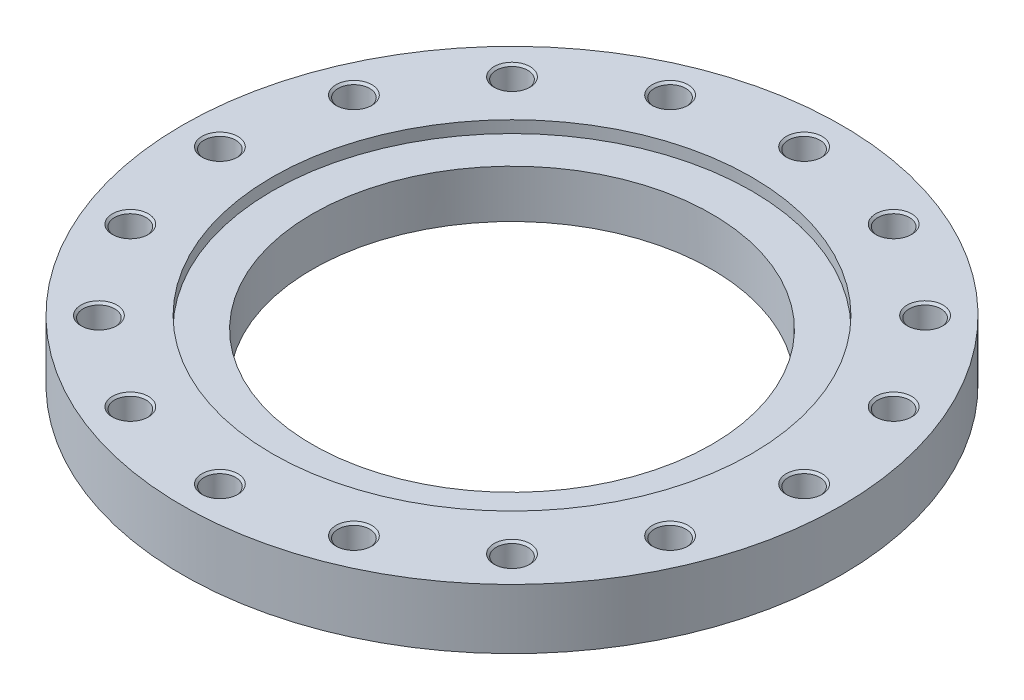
ISO-10303-21;
HEADER;
FILE_DESCRIPTION(('STEP AP214'),'2;1');
FILE_NAME('part.step','',(''),(''),'','','');
FILE_SCHEMA(('AUTOMOTIVE_DESIGN { 1 0 10303 214 1 1 1 1 }'));
ENDSEC;
DATA;
#1=APPLICATION_CONTEXT('core data for automotive mechanical design processes');
#2=APPLICATION_PROTOCOL_DEFINITION('international standard','automotive_design',2000,#1);
#3=PRODUCT_CONTEXT('',#1,'mechanical');
#4=PRODUCT('Part','Part','',(#3));
#5=PRODUCT_RELATED_PRODUCT_CATEGORY('part','',(#4));
#6=PRODUCT_DEFINITION_FORMATION('','',#4);
#7=PRODUCT_DEFINITION_CONTEXT('part definition',#1,'design');
#8=PRODUCT_DEFINITION('design','',#6,#7);
#9=PRODUCT_DEFINITION_SHAPE('','',#8);
#10=(LENGTH_UNIT() NAMED_UNIT(*) SI_UNIT(.MILLI.,.METRE.));
#11=(NAMED_UNIT(*) PLANE_ANGLE_UNIT() SI_UNIT($,.RADIAN.));
#12=(NAMED_UNIT(*) SI_UNIT($,.STERADIAN.) SOLID_ANGLE_UNIT());
#13=UNCERTAINTY_MEASURE_WITH_UNIT(LENGTH_MEASURE(1.E-05),#10,'distance_accuracy_value','');
#14=(GEOMETRIC_REPRESENTATION_CONTEXT(3) GLOBAL_UNCERTAINTY_ASSIGNED_CONTEXT((#13)) GLOBAL_UNIT_ASSIGNED_CONTEXT((#10,
#11,#12)) REPRESENTATION_CONTEXT('',''));
#15=CARTESIAN_POINT('',(0.,0.,0.));
#16=DIRECTION('',(0.,0.,1.));
#17=DIRECTION('',(1.,0.,0.));
#18=AXIS2_PLACEMENT_3D('',#15,#16,#17);
#19=CARTESIAN_POINT('',(0.,30.,0.));
#20=DIRECTION('',(0.,-1.,0.));
#21=DIRECTION('',(1.,0.,0.));
#22=AXIS2_PLACEMENT_3D('',#19,#20,#21);
#23=CYLINDRICAL_SURFACE('',#22,330.);
#24=CARTESIAN_POINT('',(0.,0.,0.));
#25=DIRECTION('',(0.,1.,0.));
#26=DIRECTION('',(1.,0.,0.));
#27=AXIS2_PLACEMENT_3D('',#24,#25,#26);
#28=CIRCLE('',#27,330.);
#29=CARTESIAN_POINT('',(330.,0.,0.));
#30=VERTEX_POINT('',#29);
#31=EDGE_CURVE('E9',#30,#30,#28,.T.);
#32=ORIENTED_EDGE('',*,*,#31,.T.);
#33=EDGE_LOOP('',(#32));
#34=FACE_BOUND('',#33,.T.);
#35=CARTESIAN_POINT('',(0.,60.,0.));
#36=DIRECTION('',(0.,1.,0.));
#37=DIRECTION('',(1.,0.,0.));
#38=AXIS2_PLACEMENT_3D('',#35,#36,#37);
#39=CIRCLE('',#38,330.);
#40=CARTESIAN_POINT('',(330.,60.,0.));
#41=VERTEX_POINT('',#40);
#42=EDGE_CURVE('E409',#41,#41,#39,.T.);
#43=ORIENTED_EDGE('',*,*,#42,.F.);
#44=EDGE_LOOP('',(#43));
#45=FACE_BOUND('',#44,.T.);
#46=ADVANCED_FACE('F15',(#34,#45),#23,.T.);
#47=CARTESIAN_POINT('',(265.,0.,0.));
#48=DIRECTION('',(0.,-1.,0.));
#49=DIRECTION('',(-1.,0.,0.));
#50=AXIS2_PLACEMENT_3D('',#47,#48,#49);
#51=PLANE('',#50);
#52=CARTESIAN_POINT('',(0.,0.,0.));
#53=DIRECTION('',(0.,1.,0.));
#54=DIRECTION('',(1.,0.,0.));
#55=AXIS2_PLACEMENT_3D('',#52,#53,#54);
#56=CIRCLE('',#55,200.);
#57=CARTESIAN_POINT('',(200.,0.,0.));
#58=VERTEX_POINT('',#57);
#59=EDGE_CURVE('E24',#58,#58,#56,.T.);
#60=ORIENTED_EDGE('',*,*,#59,.T.);
#61=EDGE_LOOP('',(#60));
#62=FACE_BOUND('',#61,.T.);
#63=ORIENTED_EDGE('',*,*,#31,.F.);
#64=EDGE_LOOP('',(#63));
#65=FACE_BOUND('',#64,.T.);
#66=ADVANCED_FACE('F472',(#62,#65),#51,.T.);
#67=CARTESIAN_POINT('',(0.,30.,0.));
#68=DIRECTION('',(0.,-1.,0.));
#69=DIRECTION('',(1.,0.,0.));
#70=AXIS2_PLACEMENT_3D('',#67,#68,#69);
#71=CYLINDRICAL_SURFACE('',#70,200.);
#72=ORIENTED_EDGE('',*,*,#59,.F.);
#73=EDGE_LOOP('',(#72));
#74=FACE_BOUND('',#73,.T.);
#75=CARTESIAN_POINT('',(0.,48.,0.));
#76=DIRECTION('',(0.,1.,0.));
#77=DIRECTION('',(1.,0.,0.));
#78=AXIS2_PLACEMENT_3D('',#75,#76,#77);
#79=CIRCLE('',#78,200.);
#80=CARTESIAN_POINT('',(-200.,48.,0.));
#81=VERTEX_POINT('',#80);
#82=EDGE_CURVE('E411',#81,#81,#79,.T.);
#83=ORIENTED_EDGE('',*,*,#82,.T.);
#84=EDGE_LOOP('',(#83));
#85=FACE_BOUND('',#84,.T.);
#86=ADVANCED_FACE('F451',(#74,#85),#71,.F.);
#87=CARTESIAN_POINT('',(265.,60.,0.));
#88=DIRECTION('',(0.,1.,0.));
#89=DIRECTION('',(1.,0.,0.));
#90=AXIS2_PLACEMENT_3D('',#87,#88,#89);
#91=PLANE('',#90);
#92=ORIENTED_EDGE('',*,*,#42,.T.);
#93=EDGE_LOOP('',(#92));
#94=FACE_BOUND('',#93,.T.);
#95=CARTESIAN_POINT('',(0.,60.,0.));
#96=DIRECTION('',(0.,-1.,0.));
#97=DIRECTION('',(1.,0.,0.));
#98=AXIS2_PLACEMENT_3D('',#95,#96,#97);
#99=CIRCLE('',#98,240.);
#100=CARTESIAN_POINT('',(-240.,60.,0.));
#101=VERTEX_POINT('',#100);
#102=EDGE_CURVE('E402',#101,#101,#99,.T.);
#103=ORIENTED_EDGE('',*,*,#102,.T.);
#104=EDGE_LOOP('',(#103));
#105=FACE_BOUND('',#104,.T.);
#106=CARTESIAN_POINT('',(292.5,60.,0.));
#107=DIRECTION('',(0.,-1.,0.));
#108=DIRECTION('',(1.,0.,0.));
#109=AXIS2_PLACEMENT_3D('',#106,#107,#108);
#110=CIRCLE('',#109,18.);
#111=CARTESIAN_POINT('',(310.5,60.,0.));
#112=VERTEX_POINT('',#111);
#113=EDGE_CURVE('E163',#112,#112,#110,.T.);
#114=ORIENTED_EDGE('',*,*,#113,.T.);
#115=EDGE_LOOP('',(#114));
#116=FACE_BOUND('',#115,.T.);
#117=CARTESIAN_POINT('',(270.234763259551,60.,-111.934903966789));
#118=DIRECTION('',(0.,-1.,0.));
#119=DIRECTION('',(0.923879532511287,0.,-0.38268343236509));
#120=AXIS2_PLACEMENT_3D('',#117,#118,#119);
#121=CIRCLE('',#120,18.);
#122=CARTESIAN_POINT('',(286.864594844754,60.,-118.82320574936));
#123=VERTEX_POINT('',#122);
#124=EDGE_CURVE('E363',#123,#123,#121,.T.);
#125=ORIENTED_EDGE('',*,*,#124,.T.);
#126=EDGE_LOOP('',(#125));
#127=FACE_BOUND('',#126,.T.);
#128=CARTESIAN_POINT('',(206.828733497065,60.,-206.828733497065));
#129=DIRECTION('',(0.,-1.,0.));
#130=DIRECTION('',(0.707106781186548,0.,-0.707106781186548));
#131=AXIS2_PLACEMENT_3D('',#128,#129,#130);
#132=CIRCLE('',#131,18.);
#133=CARTESIAN_POINT('',(219.556655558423,60.,-219.556655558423));
#134=VERTEX_POINT('',#133);
#135=EDGE_CURVE('E432',#134,#134,#132,.T.);
#136=ORIENTED_EDGE('',*,*,#135,.T.);
#137=EDGE_LOOP('',(#136));
#138=FACE_BOUND('',#137,.T.);
#139=CARTESIAN_POINT('',(111.934903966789,60.,-270.234763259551));
#140=DIRECTION('',(0.,-1.,0.));
#141=DIRECTION('',(0.38268343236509,0.,-0.923879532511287));
#142=AXIS2_PLACEMENT_3D('',#139,#140,#141);
#143=CIRCLE('',#142,18.);
#144=CARTESIAN_POINT('',(118.82320574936,60.,-286.864594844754));
#145=VERTEX_POINT('',#144);
#146=EDGE_CURVE('E422',#145,#145,#143,.T.);
#147=ORIENTED_EDGE('',*,*,#146,.T.);
#148=EDGE_LOOP('',(#147));
#149=FACE_BOUND('',#148,.T.);
#150=CARTESIAN_POINT('',(0.,60.,-292.5));
#151=DIRECTION('',(0.,-1.,0.));
#152=DIRECTION('',(0.,0.,-1.));
#153=AXIS2_PLACEMENT_3D('',#150,#151,#152);
#154=CIRCLE('',#153,18.);
#155=CARTESIAN_POINT('',(0.,60.,-310.5));
#156=VERTEX_POINT('',#155);
#157=EDGE_CURVE('E408',#156,#156,#154,.T.);
#158=ORIENTED_EDGE('',*,*,#157,.T.);
#159=EDGE_LOOP('',(#158));
#160=FACE_BOUND('',#159,.T.);
#161=CARTESIAN_POINT('',(-111.934903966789,60.,-270.234763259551));
#162=DIRECTION('',(0.,-1.,0.));
#163=DIRECTION('',(-0.38268343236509,0.,-0.923879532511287));
#164=AXIS2_PLACEMENT_3D('',#161,#162,#163);
#165=CIRCLE('',#164,18.);
#166=CARTESIAN_POINT('',(-118.82320574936,60.,-286.864594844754));
#167=VERTEX_POINT('',#166);
#168=EDGE_CURVE('E371',#167,#167,#165,.T.);
#169=ORIENTED_EDGE('',*,*,#168,.T.);
#170=EDGE_LOOP('',(#169));
#171=FACE_BOUND('',#170,.T.);
#172=CARTESIAN_POINT('',(-206.828733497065,60.,-206.828733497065));
#173=DIRECTION('',(0.,-1.,0.));
#174=DIRECTION('',(-0.707106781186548,0.,-0.707106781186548));
#175=AXIS2_PLACEMENT_3D('',#172,#173,#174);
#176=CIRCLE('',#175,18.);
#177=CARTESIAN_POINT('',(-219.556655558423,60.,-219.556655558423));
#178=VERTEX_POINT('',#177);
#179=EDGE_CURVE('E356',#178,#178,#176,.T.);
#180=ORIENTED_EDGE('',*,*,#179,.T.);
#181=EDGE_LOOP('',(#180));
#182=FACE_BOUND('',#181,.T.);
#183=CARTESIAN_POINT('',(-270.234763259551,60.,-111.934903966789));
#184=DIRECTION('',(0.,-1.,0.));
#185=DIRECTION('',(-0.923879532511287,0.,-0.38268343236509));
#186=AXIS2_PLACEMENT_3D('',#183,#184,#185);
#187=CIRCLE('',#186,18.);
#188=CARTESIAN_POINT('',(-286.864594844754,60.,-118.82320574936));
#189=VERTEX_POINT('',#188);
#190=EDGE_CURVE('E380',#189,#189,#187,.T.);
#191=ORIENTED_EDGE('',*,*,#190,.T.);
#192=EDGE_LOOP('',(#191));
#193=FACE_BOUND('',#192,.T.);
#194=CARTESIAN_POINT('',(-292.5,60.,0.));
#195=DIRECTION('',(0.,-1.,0.));
#196=DIRECTION('',(-1.,0.,0.));
#197=AXIS2_PLACEMENT_3D('',#194,#195,#196);
#198=CIRCLE('',#197,18.);
#199=CARTESIAN_POINT('',(-310.5,60.,0.));
#200=VERTEX_POINT('',#199);
#201=EDGE_CURVE('E373',#200,#200,#198,.T.);
#202=ORIENTED_EDGE('',*,*,#201,.T.);
#203=EDGE_LOOP('',(#202));
#204=FACE_BOUND('',#203,.T.);
#205=CARTESIAN_POINT('',(-270.234763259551,60.,111.934903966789));
#206=DIRECTION('',(0.,-1.,0.));
#207=DIRECTION('',(-0.923879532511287,0.,0.38268343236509));
#208=AXIS2_PLACEMENT_3D('',#205,#206,#207);
#209=CIRCLE('',#208,18.);
#210=CARTESIAN_POINT('',(-286.864594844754,60.,118.82320574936));
#211=VERTEX_POINT('',#210);
#212=EDGE_CURVE('E352',#211,#211,#209,.T.);
#213=ORIENTED_EDGE('',*,*,#212,.T.);
#214=EDGE_LOOP('',(#213));
#215=FACE_BOUND('',#214,.T.);
#216=CARTESIAN_POINT('',(-206.828733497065,60.,206.828733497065));
#217=DIRECTION('',(0.,-1.,0.));
#218=DIRECTION('',(-0.707106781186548,0.,0.707106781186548));
#219=AXIS2_PLACEMENT_3D('',#216,#217,#218);
#220=CIRCLE('',#219,18.);
#221=CARTESIAN_POINT('',(-219.556655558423,60.,219.556655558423));
#222=VERTEX_POINT('',#221);
#223=EDGE_CURVE('E326',#222,#222,#220,.T.);
#224=ORIENTED_EDGE('',*,*,#223,.T.);
#225=EDGE_LOOP('',(#224));
#226=FACE_BOUND('',#225,.T.);
#227=CARTESIAN_POINT('',(-111.934903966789,60.,270.234763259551));
#228=DIRECTION('',(0.,-1.,0.));
#229=DIRECTION('',(-0.382683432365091,0.,0.923879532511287));
#230=AXIS2_PLACEMENT_3D('',#227,#228,#229);
#231=CIRCLE('',#230,18.);
#232=CARTESIAN_POINT('',(-118.82320574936,60.,286.864594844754));
#233=VERTEX_POINT('',#232);
#234=EDGE_CURVE('E588',#233,#233,#231,.T.);
#235=ORIENTED_EDGE('',*,*,#234,.T.);
#236=EDGE_LOOP('',(#235));
#237=FACE_BOUND('',#236,.T.);
#238=CARTESIAN_POINT('',(0.,60.,292.5));
#239=DIRECTION('',(0.,-1.,0.));
#240=DIRECTION('',(0.,0.,1.));
#241=AXIS2_PLACEMENT_3D('',#238,#239,#240);
#242=CIRCLE('',#241,18.);
#243=CARTESIAN_POINT('',(0.,60.,310.5));
#244=VERTEX_POINT('',#243);
#245=EDGE_CURVE('E571',#244,#244,#242,.T.);
#246=ORIENTED_EDGE('',*,*,#245,.T.);
#247=EDGE_LOOP('',(#246));
#248=FACE_BOUND('',#247,.T.);
#249=CARTESIAN_POINT('',(111.934903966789,60.,270.234763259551));
#250=DIRECTION('',(0.,-1.,0.));
#251=DIRECTION('',(0.38268343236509,0.,0.923879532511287));
#252=AXIS2_PLACEMENT_3D('',#249,#250,#251);
#253=CIRCLE('',#252,18.);
#254=CARTESIAN_POINT('',(118.82320574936,60.,286.864594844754));
#255=VERTEX_POINT('',#254);
#256=EDGE_CURVE('E1101',#255,#255,#253,.T.);
#257=ORIENTED_EDGE('',*,*,#256,.T.);
#258=EDGE_LOOP('',(#257));
#259=FACE_BOUND('',#258,.T.);
#260=CARTESIAN_POINT('',(206.828733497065,60.,206.828733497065));
#261=DIRECTION('',(0.,-1.,0.));
#262=DIRECTION('',(0.707106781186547,0.,0.707106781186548));
#263=AXIS2_PLACEMENT_3D('',#260,#261,#262);
#264=CIRCLE('',#263,18.);
#265=CARTESIAN_POINT('',(219.556655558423,60.,219.556655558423));
#266=VERTEX_POINT('',#265);
#267=EDGE_CURVE('E1509',#266,#266,#264,.T.);
#268=ORIENTED_EDGE('',*,*,#267,.T.);
#269=EDGE_LOOP('',(#268));
#270=FACE_BOUND('',#269,.T.);
#271=CARTESIAN_POINT('',(270.234763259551,60.,111.934903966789));
#272=DIRECTION('',(0.,-1.,0.));
#273=DIRECTION('',(0.923879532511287,0.,0.382683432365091));
#274=AXIS2_PLACEMENT_3D('',#271,#272,#273);
#275=CIRCLE('',#274,18.);
#276=CARTESIAN_POINT('',(286.864594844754,60.,118.823205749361));
#277=VERTEX_POINT('',#276);
#278=EDGE_CURVE('E1494',#277,#277,#275,.T.);
#279=ORIENTED_EDGE('',*,*,#278,.T.);
#280=EDGE_LOOP('',(#279));
#281=FACE_BOUND('',#280,.T.);
#282=ADVANCED_FACE('F456',(#94,#105,#116,#127,#138,#149,#160,#171,#182,#193,#204,#215,#226,#237,
#248,#259,#270,#281),#91,.T.);
#283=CARTESIAN_POINT('',(0.,48.,0.));
#284=DIRECTION('',(0.,-1.,0.));
#285=DIRECTION('',(-1.,0.,0.));
#286=AXIS2_PLACEMENT_3D('',#283,#284,#285);
#287=PLANE('',#286);
#288=CARTESIAN_POINT('',(0.,48.,0.));
#289=DIRECTION('',(0.,-1.,0.));
#290=DIRECTION('',(1.,0.,0.));
#291=AXIS2_PLACEMENT_3D('',#288,#289,#290);
#292=CIRCLE('',#291,240.);
#293=CARTESIAN_POINT('',(240.,48.,0.));
#294=VERTEX_POINT('',#293);
#295=EDGE_CURVE('E405',#294,#294,#292,.T.);
#296=ORIENTED_EDGE('',*,*,#295,.F.);
#297=EDGE_LOOP('',(#296));
#298=FACE_BOUND('',#297,.T.);
#299=ORIENTED_EDGE('',*,*,#82,.F.);
#300=EDGE_LOOP('',(#299));
#301=FACE_BOUND('',#300,.T.);
#302=ADVANCED_FACE('F454',(#298,#301),#287,.F.);
#303=CARTESIAN_POINT('',(0.,57.,0.));
#304=DIRECTION('',(0.,-1.,0.));
#305=DIRECTION('',(1.,0.,0.));
#306=AXIS2_PLACEMENT_3D('',#303,#304,#305);
#307=CYLINDRICAL_SURFACE('',#306,240.);
#308=ORIENTED_EDGE('',*,*,#295,.T.);
#309=EDGE_LOOP('',(#308));
#310=FACE_BOUND('',#309,.T.);
#311=ORIENTED_EDGE('',*,*,#102,.F.);
#312=EDGE_LOOP('',(#311));
#313=FACE_BOUND('',#312,.T.);
#314=ADVANCED_FACE('F17',(#310,#313),#307,.F.);
#315=CARTESIAN_POINT('',(292.5,8.42882924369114,0.));
#316=DIRECTION('',(0.,1.,0.));
#317=DIRECTION('',(1.,0.,0.));
#318=AXIS2_PLACEMENT_3D('',#315,#316,#317);
#319=CONICAL_SURFACE('',#318,7.9175,1.0471975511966);
#320=CARTESIAN_POINT('',(292.5,13.,0.));
#321=DIRECTION('',(0.,-1.,0.));
#322=DIRECTION('',(1.,0.,0.));
#323=AXIS2_PLACEMENT_3D('',#320,#321,#322);
#324=CIRCLE('',#323,15.835);
#325=CARTESIAN_POINT('',(308.335,13.,0.));
#326=VERTEX_POINT('',#325);
#327=EDGE_CURVE('E406',#326,#326,#324,.T.);
#328=ORIENTED_EDGE('',*,*,#327,.F.);
#329=EDGE_LOOP('',(#328));
#330=FACE_BOUND('',#329,.T.);
#331=CARTESIAN_POINT('',(292.5,3.85765848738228,0.));
#332=VERTEX_POINT('',#331);
#333=VERTEX_LOOP('',#332);
#334=FACE_BOUND('',#333,.T.);
#335=ADVANCED_FACE('F464',(#330,#334),#319,.F.);
#336=CARTESIAN_POINT('',(292.5,17.9175,0.));
#337=DIRECTION('',(0.,1.,0.));
#338=DIRECTION('',(1.,0.,0.));
#339=AXIS2_PLACEMENT_3D('',#336,#337,#338);
#340=CYLINDRICAL_SURFACE('',#339,15.835);
#341=CARTESIAN_POINT('',(292.5,22.835,0.));
#342=DIRECTION('',(0.,-1.,0.));
#343=DIRECTION('',(1.,0.,0.));
#344=AXIS2_PLACEMENT_3D('',#341,#342,#343);
#345=CIRCLE('',#344,15.835);
#346=CARTESIAN_POINT('',(308.335,22.835,0.));
#347=VERTEX_POINT('',#346);
#348=EDGE_CURVE('E447',#347,#347,#345,.T.);
#349=ORIENTED_EDGE('',*,*,#348,.F.);
#350=EDGE_LOOP('',(#349));
#351=FACE_BOUND('',#350,.T.);
#352=ORIENTED_EDGE('',*,*,#327,.T.);
#353=EDGE_LOOP('',(#352));
#354=FACE_BOUND('',#353,.T.);
#355=ADVANCED_FACE('F1037',(#351,#354),#340,.F.);
#356=CARTESIAN_POINT('',(292.5,23.9175,0.));
#357=DIRECTION('',(0.,1.,0.));
#358=DIRECTION('',(1.,0.,0.));
#359=AXIS2_PLACEMENT_3D('',#356,#357,#358);
#360=CONICAL_SURFACE('',#359,16.9175,0.785398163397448);
#361=CARTESIAN_POINT('',(292.5,25.,0.));
#362=DIRECTION('',(0.,-1.,0.));
#363=DIRECTION('',(1.,0.,0.));
#364=AXIS2_PLACEMENT_3D('',#361,#362,#363);
#365=CIRCLE('',#364,18.);
#366=CARTESIAN_POINT('',(310.5,25.,0.));
#367=VERTEX_POINT('',#366);
#368=EDGE_CURVE('E393',#367,#367,#365,.T.);
#369=ORIENTED_EDGE('',*,*,#368,.F.);
#370=EDGE_LOOP('',(#369));
#371=FACE_BOUND('',#370,.T.);
#372=ORIENTED_EDGE('',*,*,#348,.T.);
#373=EDGE_LOOP('',(#372));
#374=FACE_BOUND('',#373,.T.);
#375=ADVANCED_FACE('F629',(#371,#374),#360,.F.);
#376=CARTESIAN_POINT('',(309.4175,25.,0.));
#377=DIRECTION('',(0.,1.,0.));
#378=DIRECTION('',(-1.,0.,0.));
#379=AXIS2_PLACEMENT_3D('',#376,#377,#378);
#380=PLANE('',#379);
#381=CARTESIAN_POINT('',(292.5,25.,0.));
#382=DIRECTION('',(0.,-1.,0.));
#383=DIRECTION('',(1.,0.,0.));
#384=AXIS2_PLACEMENT_3D('',#381,#382,#383);
#385=CIRCLE('',#384,15.835);
#386=CARTESIAN_POINT('',(308.335,25.,0.));
#387=VERTEX_POINT('',#386);
#388=EDGE_CURVE('E168',#387,#387,#385,.T.);
#389=ORIENTED_EDGE('',*,*,#388,.F.);
#390=EDGE_LOOP('',(#389));
#391=FACE_BOUND('',#390,.T.);
#392=ORIENTED_EDGE('',*,*,#368,.T.);
#393=EDGE_LOOP('',(#392));
#394=FACE_BOUND('',#393,.T.);
#395=ADVANCED_FACE('F625',(#391,#394),#380,.F.);
#396=CARTESIAN_POINT('',(292.5,41.4175,0.));
#397=DIRECTION('',(0.,1.,0.));
#398=DIRECTION('',(1.,0.,0.));
#399=AXIS2_PLACEMENT_3D('',#396,#397,#398);
#400=CYLINDRICAL_SURFACE('',#399,15.835);
#401=CARTESIAN_POINT('',(292.5,57.835,0.));
#402=DIRECTION('',(0.,-1.,0.));
#403=DIRECTION('',(1.,0.,0.));
#404=AXIS2_PLACEMENT_3D('',#401,#402,#403);
#405=CIRCLE('',#404,15.835);
#406=CARTESIAN_POINT('',(308.335,57.835,0.));
#407=VERTEX_POINT('',#406);
#408=EDGE_CURVE('E346',#407,#407,#405,.T.);
#409=ORIENTED_EDGE('',*,*,#408,.F.);
#410=EDGE_LOOP('',(#409));
#411=FACE_BOUND('',#410,.T.);
#412=ORIENTED_EDGE('',*,*,#388,.T.);
#413=EDGE_LOOP('',(#412));
#414=FACE_BOUND('',#413,.T.);
#415=ADVANCED_FACE('F628',(#411,#414),#400,.F.);
#416=CARTESIAN_POINT('',(292.5,58.9175,0.));
#417=DIRECTION('',(0.,1.,0.));
#418=DIRECTION('',(1.,0.,0.));
#419=AXIS2_PLACEMENT_3D('',#416,#417,#418);
#420=CONICAL_SURFACE('',#419,16.9175,0.785398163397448);
#421=ORIENTED_EDGE('',*,*,#113,.F.);
#422=EDGE_LOOP('',(#421));
#423=FACE_BOUND('',#422,.T.);
#424=ORIENTED_EDGE('',*,*,#408,.T.);
#425=EDGE_LOOP('',(#424));
#426=FACE_BOUND('',#425,.T.);
#427=ADVANCED_FACE('F1003',(#423,#426),#420,.F.);
#428=CARTESIAN_POINT('',(270.234763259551,8.42882924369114,-111.934903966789));
#429=DIRECTION('',(0.,1.,0.));
#430=DIRECTION('',(0.923879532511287,0.,-0.38268343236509));
#431=AXIS2_PLACEMENT_3D('',#428,#429,#430);
#432=CONICAL_SURFACE('',#431,7.9175,1.0471975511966);
#433=CARTESIAN_POINT('',(270.234763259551,13.,-111.934903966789));
#434=DIRECTION('',(0.,-1.,0.));
#435=DIRECTION('',(0.923879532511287,0.,-0.38268343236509));
#436=AXIS2_PLACEMENT_3D('',#433,#434,#435);
#437=CIRCLE('',#436,15.835);
#438=CARTESIAN_POINT('',(284.864395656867,13.,-117.99469611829));
#439=VERTEX_POINT('',#438);
#440=EDGE_CURVE('E434',#439,#439,#437,.T.);
#441=ORIENTED_EDGE('',*,*,#440,.F.);
#442=EDGE_LOOP('',(#441));
#443=FACE_BOUND('',#442,.T.);
#444=CARTESIAN_POINT('',(270.234763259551,3.85765848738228,-111.934903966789));
#445=VERTEX_POINT('',#444);
#446=VERTEX_LOOP('',#445);
#447=FACE_BOUND('',#446,.T.);
#448=ADVANCED_FACE('F993',(#443,#447),#432,.F.);
#449=CARTESIAN_POINT('',(270.234763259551,17.9175,-111.934903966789));
#450=DIRECTION('',(0.,1.,0.));
#451=DIRECTION('',(0.923879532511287,0.,-0.38268343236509));
#452=AXIS2_PLACEMENT_3D('',#449,#450,#451);
#453=CYLINDRICAL_SURFACE('',#452,15.835);
#454=CARTESIAN_POINT('',(270.234763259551,22.835,-111.934903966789));
#455=DIRECTION('',(0.,-1.,0.));
#456=DIRECTION('',(0.923879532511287,0.,-0.38268343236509));
#457=AXIS2_PLACEMENT_3D('',#454,#455,#456);
#458=CIRCLE('',#457,15.835);
#459=CARTESIAN_POINT('',(284.864395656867,22.835,-117.99469611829));
#460=VERTEX_POINT('',#459);
#461=EDGE_CURVE('E444',#460,#460,#458,.T.);
#462=ORIENTED_EDGE('',*,*,#461,.F.);
#463=EDGE_LOOP('',(#462));
#464=FACE_BOUND('',#463,.T.);
#465=ORIENTED_EDGE('',*,*,#440,.T.);
#466=EDGE_LOOP('',(#465));
#467=FACE_BOUND('',#466,.T.);
#468=ADVANCED_FACE('F662',(#464,#467),#453,.F.);
#469=CARTESIAN_POINT('',(270.234763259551,23.9175,-111.934903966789));
#470=DIRECTION('',(0.,1.,0.));
#471=DIRECTION('',(0.923879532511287,0.,-0.38268343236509));
#472=AXIS2_PLACEMENT_3D('',#469,#470,#471);
#473=CONICAL_SURFACE('',#472,16.9175,0.785398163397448);
#474=CARTESIAN_POINT('',(270.234763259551,25.,-111.934903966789));
#475=DIRECTION('',(0.,-1.,0.));
#476=DIRECTION('',(0.923879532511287,0.,-0.38268343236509));
#477=AXIS2_PLACEMENT_3D('',#474,#475,#476);
#478=CIRCLE('',#477,18.);
#479=CARTESIAN_POINT('',(286.864594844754,25.,-118.82320574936));
#480=VERTEX_POINT('',#479);
#481=EDGE_CURVE('E362',#480,#480,#478,.T.);
#482=ORIENTED_EDGE('',*,*,#481,.F.);
#483=EDGE_LOOP('',(#482));
#484=FACE_BOUND('',#483,.T.);
#485=ORIENTED_EDGE('',*,*,#461,.T.);
#486=EDGE_LOOP('',(#485));
#487=FACE_BOUND('',#486,.T.);
#488=ADVANCED_FACE('F498',(#484,#487),#473,.F.);
#489=CARTESIAN_POINT('',(285.864495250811,25.,-118.408950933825));
#490=DIRECTION('',(0.,1.,0.));
#491=DIRECTION('',(-0.923879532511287,0.,0.38268343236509));
#492=AXIS2_PLACEMENT_3D('',#489,#490,#491);
#493=PLANE('',#492);
#494=CARTESIAN_POINT('',(270.234763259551,25.,-111.934903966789));
#495=DIRECTION('',(0.,-1.,0.));
#496=DIRECTION('',(0.923879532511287,0.,-0.38268343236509));
#497=AXIS2_PLACEMENT_3D('',#494,#495,#496);
#498=CIRCLE('',#497,15.835);
#499=CARTESIAN_POINT('',(284.864395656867,25.,-117.99469611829));
#500=VERTEX_POINT('',#499);
#501=EDGE_CURVE('E360',#500,#500,#498,.T.);
#502=ORIENTED_EDGE('',*,*,#501,.F.);
#503=EDGE_LOOP('',(#502));
#504=FACE_BOUND('',#503,.T.);
#505=ORIENTED_EDGE('',*,*,#481,.T.);
#506=EDGE_LOOP('',(#505));
#507=FACE_BOUND('',#506,.T.);
#508=ADVANCED_FACE('F494',(#504,#507),#493,.F.);
#509=CARTESIAN_POINT('',(270.234763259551,41.4175,-111.934903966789));
#510=DIRECTION('',(0.,1.,0.));
#511=DIRECTION('',(0.923879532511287,0.,-0.38268343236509));
#512=AXIS2_PLACEMENT_3D('',#509,#510,#511);
#513=CYLINDRICAL_SURFACE('',#512,15.835);
#514=CARTESIAN_POINT('',(270.234763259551,57.835,-111.934903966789));
#515=DIRECTION('',(0.,-1.,0.));
#516=DIRECTION('',(0.923879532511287,0.,-0.38268343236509));
#517=AXIS2_PLACEMENT_3D('',#514,#515,#516);
#518=CIRCLE('',#517,15.835);
#519=CARTESIAN_POINT('',(284.864395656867,57.835,-117.99469611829));
#520=VERTEX_POINT('',#519);
#521=EDGE_CURVE('E439',#520,#520,#518,.T.);
#522=ORIENTED_EDGE('',*,*,#521,.F.);
#523=EDGE_LOOP('',(#522));
#524=FACE_BOUND('',#523,.T.);
#525=ORIENTED_EDGE('',*,*,#501,.T.);
#526=EDGE_LOOP('',(#525));
#527=FACE_BOUND('',#526,.T.);
#528=ADVANCED_FACE('F497',(#524,#527),#513,.F.);
#529=CARTESIAN_POINT('',(270.234763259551,58.9175,-111.934903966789));
#530=DIRECTION('',(0.,1.,0.));
#531=DIRECTION('',(0.923879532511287,0.,-0.38268343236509));
#532=AXIS2_PLACEMENT_3D('',#529,#530,#531);
#533=CONICAL_SURFACE('',#532,16.9175,0.785398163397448);
#534=ORIENTED_EDGE('',*,*,#124,.F.);
#535=EDGE_LOOP('',(#534));
#536=FACE_BOUND('',#535,.T.);
#537=ORIENTED_EDGE('',*,*,#521,.T.);
#538=EDGE_LOOP('',(#537));
#539=FACE_BOUND('',#538,.T.);
#540=ADVANCED_FACE('F953',(#536,#539),#533,.F.);
#541=CARTESIAN_POINT('',(206.828733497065,8.42882924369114,-206.828733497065));
#542=DIRECTION('',(0.,1.,0.));
#543=DIRECTION('',(0.707106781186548,0.,-0.707106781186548));
#544=AXIS2_PLACEMENT_3D('',#541,#542,#543);
#545=CONICAL_SURFACE('',#544,7.9175,1.0471975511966);
#546=CARTESIAN_POINT('',(206.828733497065,13.,-206.828733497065));
#547=DIRECTION('',(0.,-1.,0.));
#548=DIRECTION('',(0.707106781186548,0.,-0.707106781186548));
#549=AXIS2_PLACEMENT_3D('',#546,#547,#548);
#550=CIRCLE('',#549,15.835);
#551=CARTESIAN_POINT('',(218.025769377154,13.,-218.025769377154));
#552=VERTEX_POINT('',#551);
#553=EDGE_CURVE('E335',#552,#552,#550,.T.);
#554=ORIENTED_EDGE('',*,*,#553,.F.);
#555=EDGE_LOOP('',(#554));
#556=FACE_BOUND('',#555,.T.);
#557=CARTESIAN_POINT('',(206.828733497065,3.85765848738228,-206.828733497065));
#558=VERTEX_POINT('',#557);
#559=VERTEX_LOOP('',#558);
#560=FACE_BOUND('',#559,.T.);
#561=ADVANCED_FACE('F943',(#556,#560),#545,.F.);
#562=CARTESIAN_POINT('',(206.828733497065,17.9175,-206.828733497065));
#563=DIRECTION('',(0.,1.,0.));
#564=DIRECTION('',(0.707106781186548,0.,-0.707106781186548));
#565=AXIS2_PLACEMENT_3D('',#562,#563,#564);
#566=CYLINDRICAL_SURFACE('',#565,15.835);
#567=CARTESIAN_POINT('',(206.828733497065,22.835,-206.828733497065));
#568=DIRECTION('',(0.,-1.,0.));
#569=DIRECTION('',(0.707106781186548,0.,-0.707106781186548));
#570=AXIS2_PLACEMENT_3D('',#567,#568,#569);
#571=CIRCLE('',#570,15.835);
#572=CARTESIAN_POINT('',(218.025769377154,22.835,-218.025769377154));
#573=VERTEX_POINT('',#572);
#574=EDGE_CURVE('E333',#573,#573,#571,.T.);
#575=ORIENTED_EDGE('',*,*,#574,.F.);
#576=EDGE_LOOP('',(#575));
#577=FACE_BOUND('',#576,.T.);
#578=ORIENTED_EDGE('',*,*,#553,.T.);
#579=EDGE_LOOP('',(#578));
#580=FACE_BOUND('',#579,.T.);
#581=ADVANCED_FACE('F650',(#577,#580),#566,.F.);
#582=CARTESIAN_POINT('',(206.828733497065,23.9175,-206.828733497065));
#583=DIRECTION('',(0.,1.,0.));
#584=DIRECTION('',(0.707106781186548,0.,-0.707106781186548));
#585=AXIS2_PLACEMENT_3D('',#582,#583,#584);
#586=CONICAL_SURFACE('',#585,16.9175,0.785398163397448);
#587=CARTESIAN_POINT('',(206.828733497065,25.,-206.828733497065));
#588=DIRECTION('',(0.,-1.,0.));
#589=DIRECTION('',(0.707106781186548,0.,-0.707106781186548));
#590=AXIS2_PLACEMENT_3D('',#587,#588,#589);
#591=CIRCLE('',#590,18.);
#592=CARTESIAN_POINT('',(219.556655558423,25.,-219.556655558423));
#593=VERTEX_POINT('',#592);
#594=EDGE_CURVE('E336',#593,#593,#591,.T.);
#595=ORIENTED_EDGE('',*,*,#594,.F.);
#596=EDGE_LOOP('',(#595));
#597=FACE_BOUND('',#596,.T.);
#598=ORIENTED_EDGE('',*,*,#574,.T.);
#599=EDGE_LOOP('',(#598));
#600=FACE_BOUND('',#599,.T.);
#601=ADVANCED_FACE('F646',(#597,#600),#586,.F.);
#602=CARTESIAN_POINT('',(218.791212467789,25.,-218.791212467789));
#603=DIRECTION('',(0.,1.,0.));
#604=DIRECTION('',(-0.707106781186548,0.,0.707106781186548));
#605=AXIS2_PLACEMENT_3D('',#602,#603,#604);
#606=PLANE('',#605);
#607=CARTESIAN_POINT('',(206.828733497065,25.,-206.828733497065));
#608=DIRECTION('',(0.,-1.,0.));
#609=DIRECTION('',(0.707106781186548,0.,-0.707106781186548));
#610=AXIS2_PLACEMENT_3D('',#607,#608,#609);
#611=CIRCLE('',#610,15.835);
#612=CARTESIAN_POINT('',(218.025769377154,25.,-218.025769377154));
#613=VERTEX_POINT('',#612);
#614=EDGE_CURVE('E376',#613,#613,#611,.T.);
#615=ORIENTED_EDGE('',*,*,#614,.F.);
#616=EDGE_LOOP('',(#615));
#617=FACE_BOUND('',#616,.T.);
#618=ORIENTED_EDGE('',*,*,#594,.T.);
#619=EDGE_LOOP('',(#618));
#620=FACE_BOUND('',#619,.T.);
#621=ADVANCED_FACE('F649',(#617,#620),#606,.F.);
#622=CARTESIAN_POINT('',(206.828733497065,41.4175,-206.828733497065));
#623=DIRECTION('',(0.,1.,0.));
#624=DIRECTION('',(0.707106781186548,0.,-0.707106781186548));
#625=AXIS2_PLACEMENT_3D('',#622,#623,#624);
#626=CYLINDRICAL_SURFACE('',#625,15.835);
#627=CARTESIAN_POINT('',(206.828733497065,57.835,-206.828733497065));
#628=DIRECTION('',(0.,-1.,0.));
#629=DIRECTION('',(0.707106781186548,0.,-0.707106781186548));
#630=AXIS2_PLACEMENT_3D('',#627,#628,#629);
#631=CIRCLE('',#630,15.835);
#632=CARTESIAN_POINT('',(218.025769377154,57.835,-218.025769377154));
#633=VERTEX_POINT('',#632);
#634=EDGE_CURVE('E430',#633,#633,#631,.T.);
#635=ORIENTED_EDGE('',*,*,#634,.F.);
#636=EDGE_LOOP('',(#635));
#637=FACE_BOUND('',#636,.T.);
#638=ORIENTED_EDGE('',*,*,#614,.T.);
#639=EDGE_LOOP('',(#638));
#640=FACE_BOUND('',#639,.T.);
#641=ADVANCED_FACE('F909',(#637,#640),#626,.F.);
#642=CARTESIAN_POINT('',(206.828733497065,58.9175,-206.828733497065));
#643=DIRECTION('',(0.,1.,0.));
#644=DIRECTION('',(0.707106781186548,0.,-0.707106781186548));
#645=AXIS2_PLACEMENT_3D('',#642,#643,#644);
#646=CONICAL_SURFACE('',#645,16.9175,0.785398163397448);
#647=ORIENTED_EDGE('',*,*,#135,.F.);
#648=EDGE_LOOP('',(#647));
#649=FACE_BOUND('',#648,.T.);
#650=ORIENTED_EDGE('',*,*,#634,.T.);
#651=EDGE_LOOP('',(#650));
#652=FACE_BOUND('',#651,.T.);
#653=ADVANCED_FACE('F899',(#649,#652),#646,.F.);
#654=CARTESIAN_POINT('',(111.934903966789,8.42882924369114,-270.234763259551));
#655=DIRECTION('',(0.,1.,0.));
#656=DIRECTION('',(0.38268343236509,0.,-0.923879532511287));
#657=AXIS2_PLACEMENT_3D('',#654,#655,#656);
#658=CONICAL_SURFACE('',#657,7.9175,1.0471975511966);
#659=CARTESIAN_POINT('',(111.934903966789,13.,-270.234763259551));
#660=DIRECTION('',(0.,-1.,0.));
#661=DIRECTION('',(0.38268343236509,0.,-0.923879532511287));
#662=AXIS2_PLACEMENT_3D('',#659,#660,#661);
#663=CIRCLE('',#662,15.835);
#664=CARTESIAN_POINT('',(117.99469611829,13.,-284.864395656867));
#665=VERTEX_POINT('',#664);
#666=EDGE_CURVE('E426',#665,#665,#663,.T.);
#667=ORIENTED_EDGE('',*,*,#666,.F.);
#668=EDGE_LOOP('',(#667));
#669=FACE_BOUND('',#668,.T.);
#670=CARTESIAN_POINT('',(111.934903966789,3.85765848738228,-270.234763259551));
#671=VERTEX_POINT('',#670);
#672=VERTEX_LOOP('',#671);
#673=FACE_BOUND('',#672,.T.);
#674=ADVANCED_FACE('F889',(#669,#673),#658,.F.);
#675=CARTESIAN_POINT('',(111.934903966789,17.9175,-270.234763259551));
#676=DIRECTION('',(0.,1.,0.));
#677=DIRECTION('',(0.38268343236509,0.,-0.923879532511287));
#678=AXIS2_PLACEMENT_3D('',#675,#676,#677);
#679=CYLINDRICAL_SURFACE('',#678,15.835);
#680=CARTESIAN_POINT('',(111.934903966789,22.835,-270.234763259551));
#681=DIRECTION('',(0.,-1.,0.));
#682=DIRECTION('',(0.38268343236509,0.,-0.923879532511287));
#683=AXIS2_PLACEMENT_3D('',#680,#681,#682);
#684=CIRCLE('',#683,15.835);
#685=CARTESIAN_POINT('',(117.99469611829,22.835,-284.864395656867));
#686=VERTEX_POINT('',#685);
#687=EDGE_CURVE('E423',#686,#686,#684,.T.);
#688=ORIENTED_EDGE('',*,*,#687,.F.);
#689=EDGE_LOOP('',(#688));
#690=FACE_BOUND('',#689,.T.);
#691=ORIENTED_EDGE('',*,*,#666,.T.);
#692=EDGE_LOOP('',(#691));
#693=FACE_BOUND('',#692,.T.);
#694=ADVANCED_FACE('F879',(#690,#693),#679,.F.);
#695=CARTESIAN_POINT('',(111.934903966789,23.9175,-270.234763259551));
#696=DIRECTION('',(0.,1.,0.));
#697=DIRECTION('',(0.38268343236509,0.,-0.923879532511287));
#698=AXIS2_PLACEMENT_3D('',#695,#696,#697);
#699=CONICAL_SURFACE('',#698,16.9175,0.785398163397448);
#700=CARTESIAN_POINT('',(111.934903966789,25.,-270.234763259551));
#701=DIRECTION('',(0.,-1.,0.));
#702=DIRECTION('',(0.38268343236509,0.,-0.923879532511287));
#703=AXIS2_PLACEMENT_3D('',#700,#701,#702);
#704=CIRCLE('',#703,18.);
#705=CARTESIAN_POINT('',(118.82320574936,25.,-286.864594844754));
#706=VERTEX_POINT('',#705);
#707=EDGE_CURVE('E427',#706,#706,#704,.T.);
#708=ORIENTED_EDGE('',*,*,#707,.F.);
#709=EDGE_LOOP('',(#708));
#710=FACE_BOUND('',#709,.T.);
#711=ORIENTED_EDGE('',*,*,#687,.T.);
#712=EDGE_LOOP('',(#711));
#713=FACE_BOUND('',#712,.T.);
#714=ADVANCED_FACE('F869',(#710,#713),#699,.F.);
#715=CARTESIAN_POINT('',(118.408950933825,25.,-285.864495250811));
#716=DIRECTION('',(0.,1.,0.));
#717=DIRECTION('',(-0.38268343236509,0.,0.923879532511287));
#718=AXIS2_PLACEMENT_3D('',#715,#716,#717);
#719=PLANE('',#718);
#720=CARTESIAN_POINT('',(111.934903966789,25.,-270.234763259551));
#721=DIRECTION('',(0.,-1.,0.));
#722=DIRECTION('',(0.38268343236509,0.,-0.923879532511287));
#723=AXIS2_PLACEMENT_3D('',#720,#721,#722);
#724=CIRCLE('',#723,15.835);
#725=CARTESIAN_POINT('',(117.99469611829,25.,-284.864395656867));
#726=VERTEX_POINT('',#725);
#727=EDGE_CURVE('E1511',#726,#726,#724,.T.);
#728=ORIENTED_EDGE('',*,*,#727,.F.);
#729=EDGE_LOOP('',(#728));
#730=FACE_BOUND('',#729,.T.);
#731=ORIENTED_EDGE('',*,*,#707,.T.);
#732=EDGE_LOOP('',(#731));
#733=FACE_BOUND('',#732,.T.);
#734=ADVANCED_FACE('F859',(#730,#733),#719,.F.);
#735=CARTESIAN_POINT('',(111.934903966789,41.4175,-270.234763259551));
#736=DIRECTION('',(0.,1.,0.));
#737=DIRECTION('',(0.38268343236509,0.,-0.923879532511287));
#738=AXIS2_PLACEMENT_3D('',#735,#736,#737);
#739=CYLINDRICAL_SURFACE('',#738,15.835);
#740=CARTESIAN_POINT('',(111.934903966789,57.835,-270.234763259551));
#741=DIRECTION('',(0.,-1.,0.));
#742=DIRECTION('',(0.38268343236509,0.,-0.923879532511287));
#743=AXIS2_PLACEMENT_3D('',#740,#741,#742);
#744=CIRCLE('',#743,15.835);
#745=CARTESIAN_POINT('',(117.99469611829,57.835,-284.864395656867));
#746=VERTEX_POINT('',#745);
#747=EDGE_CURVE('E420',#746,#746,#744,.T.);
#748=ORIENTED_EDGE('',*,*,#747,.F.);
#749=EDGE_LOOP('',(#748));
#750=FACE_BOUND('',#749,.T.);
#751=ORIENTED_EDGE('',*,*,#727,.T.);
#752=EDGE_LOOP('',(#751));
#753=FACE_BOUND('',#752,.T.);
#754=ADVANCED_FACE('F849',(#750,#753),#739,.F.);
#755=CARTESIAN_POINT('',(111.934903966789,58.9175,-270.234763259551));
#756=DIRECTION('',(0.,1.,0.));
#757=DIRECTION('',(0.38268343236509,0.,-0.923879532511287));
#758=AXIS2_PLACEMENT_3D('',#755,#756,#757);
#759=CONICAL_SURFACE('',#758,16.9175,0.785398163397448);
#760=ORIENTED_EDGE('',*,*,#146,.F.);
#761=EDGE_LOOP('',(#760));
#762=FACE_BOUND('',#761,.T.);
#763=ORIENTED_EDGE('',*,*,#747,.T.);
#764=EDGE_LOOP('',(#763));
#765=FACE_BOUND('',#764,.T.);
#766=ADVANCED_FACE('F839',(#762,#765),#759,.F.);
#767=CARTESIAN_POINT('',(0.,8.42882924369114,-292.5));
#768=DIRECTION('',(0.,1.,0.));
#769=DIRECTION('',(0.,0.,-1.));
#770=AXIS2_PLACEMENT_3D('',#767,#768,#769);
#771=CONICAL_SURFACE('',#770,7.9175,1.0471975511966);
#772=CARTESIAN_POINT('',(0.,13.,-292.5));
#773=DIRECTION('',(0.,-1.,0.));
#774=DIRECTION('',(0.,0.,-1.));
#775=AXIS2_PLACEMENT_3D('',#772,#773,#774);
#776=CIRCLE('',#775,15.835);
#777=CARTESIAN_POINT('',(0.,13.,-308.335));
#778=VERTEX_POINT('',#777);
#779=EDGE_CURVE('E418',#778,#778,#776,.T.);
#780=ORIENTED_EDGE('',*,*,#779,.F.);
#781=EDGE_LOOP('',(#780));
#782=FACE_BOUND('',#781,.T.);
#783=CARTESIAN_POINT('',(0.,3.85765848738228,-292.5));
#784=VERTEX_POINT('',#783);
#785=VERTEX_LOOP('',#784);
#786=FACE_BOUND('',#785,.T.);
#787=ADVANCED_FACE('F830',(#782,#786),#771,.F.);
#788=CARTESIAN_POINT('',(0.,17.9175,-292.5));
#789=DIRECTION('',(0.,1.,0.));
#790=DIRECTION('',(0.,0.,-1.));
#791=AXIS2_PLACEMENT_3D('',#788,#789,#790);
#792=CYLINDRICAL_SURFACE('',#791,15.835);
#793=CARTESIAN_POINT('',(0.,22.835,-292.5));
#794=DIRECTION('',(0.,-1.,0.));
#795=DIRECTION('',(0.,0.,-1.));
#796=AXIS2_PLACEMENT_3D('',#793,#794,#795);
#797=CIRCLE('',#796,15.835);
#798=CARTESIAN_POINT('',(0.,22.835,-308.335));
#799=VERTEX_POINT('',#798);
#800=EDGE_CURVE('E417',#799,#799,#797,.T.);
#801=ORIENTED_EDGE('',*,*,#800,.F.);
#802=EDGE_LOOP('',(#801));
#803=FACE_BOUND('',#802,.T.);
#804=ORIENTED_EDGE('',*,*,#779,.T.);
#805=EDGE_LOOP('',(#804));
#806=FACE_BOUND('',#805,.T.);
#807=ADVANCED_FACE('F560',(#803,#806),#792,.F.);
#808=CARTESIAN_POINT('',(0.,23.9175,-292.5));
#809=DIRECTION('',(0.,1.,0.));
#810=DIRECTION('',(0.,0.,-1.));
#811=AXIS2_PLACEMENT_3D('',#808,#809,#810);
#812=CONICAL_SURFACE('',#811,16.9175,0.785398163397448);
#813=CARTESIAN_POINT('',(0.,25.,-292.5));
#814=DIRECTION('',(0.,-1.,0.));
#815=DIRECTION('',(0.,0.,-1.));
#816=AXIS2_PLACEMENT_3D('',#813,#814,#815);
#817=CIRCLE('',#816,18.);
#818=CARTESIAN_POINT('',(0.,25.,-310.5));
#819=VERTEX_POINT('',#818);
#820=EDGE_CURVE('E415',#819,#819,#817,.T.);
#821=ORIENTED_EDGE('',*,*,#820,.F.);
#822=EDGE_LOOP('',(#821));
#823=FACE_BOUND('',#822,.T.);
#824=ORIENTED_EDGE('',*,*,#800,.T.);
#825=EDGE_LOOP('',(#824));
#826=FACE_BOUND('',#825,.T.);
#827=ADVANCED_FACE('F554',(#823,#826),#812,.F.);
#828=CARTESIAN_POINT('',(0.,25.,-309.4175));
#829=DIRECTION('',(0.,1.,0.));
#830=DIRECTION('',(0.,0.,1.));
#831=AXIS2_PLACEMENT_3D('',#828,#829,#830);
#832=PLANE('',#831);
#833=CARTESIAN_POINT('',(0.,25.,-292.5));
#834=DIRECTION('',(0.,-1.,0.));
#835=DIRECTION('',(0.,0.,-1.));
#836=AXIS2_PLACEMENT_3D('',#833,#834,#835);
#837=CIRCLE('',#836,15.835);
#838=CARTESIAN_POINT('',(0.,25.,-308.335));
#839=VERTEX_POINT('',#838);
#840=EDGE_CURVE('E413',#839,#839,#837,.T.);
#841=ORIENTED_EDGE('',*,*,#840,.F.);
#842=EDGE_LOOP('',(#841));
#843=FACE_BOUND('',#842,.T.);
#844=ORIENTED_EDGE('',*,*,#820,.T.);
#845=EDGE_LOOP('',(#844));
#846=FACE_BOUND('',#845,.T.);
#847=ADVANCED_FACE('F544',(#843,#846),#832,.F.);
#848=CARTESIAN_POINT('',(0.,41.4175,-292.5));
#849=DIRECTION('',(0.,1.,0.));
#850=DIRECTION('',(0.,0.,-1.));
#851=AXIS2_PLACEMENT_3D('',#848,#849,#850);
#852=CYLINDRICAL_SURFACE('',#851,15.835);
#853=CARTESIAN_POINT('',(0.,57.835,-292.5));
#854=DIRECTION('',(0.,-1.,0.));
#855=DIRECTION('',(0.,0.,-1.));
#856=AXIS2_PLACEMENT_3D('',#853,#854,#855);
#857=CIRCLE('',#856,15.835);
#858=CARTESIAN_POINT('',(0.,57.835,-308.335));
#859=VERTEX_POINT('',#858);
#860=EDGE_CURVE('E401',#859,#859,#857,.T.);
#861=ORIENTED_EDGE('',*,*,#860,.F.);
#862=EDGE_LOOP('',(#861));
#863=FACE_BOUND('',#862,.T.);
#864=ORIENTED_EDGE('',*,*,#840,.T.);
#865=EDGE_LOOP('',(#864));
#866=FACE_BOUND('',#865,.T.);
#867=ADVANCED_FACE('F539',(#863,#866),#852,.F.);
#868=CARTESIAN_POINT('',(0.,58.9175,-292.5));
#869=DIRECTION('',(0.,1.,0.));
#870=DIRECTION('',(0.,0.,-1.));
#871=AXIS2_PLACEMENT_3D('',#868,#869,#870);
#872=CONICAL_SURFACE('',#871,16.9175,0.785398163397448);
#873=ORIENTED_EDGE('',*,*,#157,.F.);
#874=EDGE_LOOP('',(#873));
#875=FACE_BOUND('',#874,.T.);
#876=ORIENTED_EDGE('',*,*,#860,.T.);
#877=EDGE_LOOP('',(#876));
#878=FACE_BOUND('',#877,.T.);
#879=ADVANCED_FACE('F536',(#875,#878),#872,.F.);
#880=CARTESIAN_POINT('',(-111.934903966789,8.42882924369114,-270.234763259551));
#881=DIRECTION('',(0.,1.,0.));
#882=DIRECTION('',(-0.38268343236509,0.,-0.923879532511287));
#883=AXIS2_PLACEMENT_3D('',#880,#881,#882);
#884=CONICAL_SURFACE('',#883,7.9175,1.0471975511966);
#885=CARTESIAN_POINT('',(-111.934903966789,13.,-270.234763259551));
#886=DIRECTION('',(0.,-1.,0.));
#887=DIRECTION('',(-0.38268343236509,0.,-0.923879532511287));
#888=AXIS2_PLACEMENT_3D('',#885,#886,#887);
#889=CIRCLE('',#888,15.835);
#890=CARTESIAN_POINT('',(-117.99469611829,13.,-284.864395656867));
#891=VERTEX_POINT('',#890);
#892=EDGE_CURVE('E399',#891,#891,#889,.T.);
#893=ORIENTED_EDGE('',*,*,#892,.F.);
#894=EDGE_LOOP('',(#893));
#895=FACE_BOUND('',#894,.T.);
#896=CARTESIAN_POINT('',(-111.934903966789,3.85765848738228,-270.234763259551));
#897=VERTEX_POINT('',#896);
#898=VERTEX_LOOP('',#897);
#899=FACE_BOUND('',#898,.T.);
#900=ADVANCED_FACE('F532',(#895,#899),#884,.F.);
#901=CARTESIAN_POINT('',(-111.934903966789,17.9175,-270.234763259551));
#902=DIRECTION('',(0.,1.,0.));
#903=DIRECTION('',(-0.38268343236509,0.,-0.923879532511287));
#904=AXIS2_PLACEMENT_3D('',#901,#902,#903);
#905=CYLINDRICAL_SURFACE('',#904,15.835);
#906=CARTESIAN_POINT('',(-111.934903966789,22.835,-270.234763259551));
#907=DIRECTION('',(0.,-1.,0.));
#908=DIRECTION('',(-0.38268343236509,0.,-0.923879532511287));
#909=AXIS2_PLACEMENT_3D('',#906,#907,#908);
#910=CIRCLE('',#909,15.835);
#911=CARTESIAN_POINT('',(-117.99469611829,22.835,-284.864395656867));
#912=VERTEX_POINT('',#911);
#913=EDGE_CURVE('E397',#912,#912,#910,.T.);
#914=ORIENTED_EDGE('',*,*,#913,.F.);
#915=EDGE_LOOP('',(#914));
#916=FACE_BOUND('',#915,.T.);
#917=ORIENTED_EDGE('',*,*,#892,.T.);
#918=EDGE_LOOP('',(#917));
#919=FACE_BOUND('',#918,.T.);
#920=ADVANCED_FACE('F526',(#916,#919),#905,.F.);
#921=CARTESIAN_POINT('',(-111.934903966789,23.9175,-270.234763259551));
#922=DIRECTION('',(0.,1.,0.));
#923=DIRECTION('',(-0.38268343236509,0.,-0.923879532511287));
#924=AXIS2_PLACEMENT_3D('',#921,#922,#923);
#925=CONICAL_SURFACE('',#924,16.9175,0.785398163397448);
#926=CARTESIAN_POINT('',(-111.934903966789,25.,-270.234763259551));
#927=DIRECTION('',(0.,-1.,0.));
#928=DIRECTION('',(-0.38268343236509,0.,-0.923879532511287));
#929=AXIS2_PLACEMENT_3D('',#926,#927,#928);
#930=CIRCLE('',#929,18.);
#931=CARTESIAN_POINT('',(-118.82320574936,25.,-286.864594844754));
#932=VERTEX_POINT('',#931);
#933=EDGE_CURVE('E396',#932,#932,#930,.T.);
#934=ORIENTED_EDGE('',*,*,#933,.F.);
#935=EDGE_LOOP('',(#934));
#936=FACE_BOUND('',#935,.T.);
#937=ORIENTED_EDGE('',*,*,#913,.T.);
#938=EDGE_LOOP('',(#937));
#939=FACE_BOUND('',#938,.T.);
#940=ADVANCED_FACE('F522',(#936,#939),#925,.F.);
#941=CARTESIAN_POINT('',(-118.408950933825,25.,-285.864495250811));
#942=DIRECTION('',(0.,1.,0.));
#943=DIRECTION('',(0.38268343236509,0.,0.923879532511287));
#944=AXIS2_PLACEMENT_3D('',#941,#942,#943);
#945=PLANE('',#944);
#946=CARTESIAN_POINT('',(-111.934903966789,25.,-270.234763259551));
#947=DIRECTION('',(0.,-1.,0.));
#948=DIRECTION('',(-0.38268343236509,0.,-0.923879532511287));
#949=AXIS2_PLACEMENT_3D('',#946,#947,#948);
#950=CIRCLE('',#949,15.835);
#951=CARTESIAN_POINT('',(-117.99469611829,25.,-284.864395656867));
#952=VERTEX_POINT('',#951);
#953=EDGE_CURVE('E394',#952,#952,#950,.T.);
#954=ORIENTED_EDGE('',*,*,#953,.F.);
#955=EDGE_LOOP('',(#954));
#956=FACE_BOUND('',#955,.T.);
#957=ORIENTED_EDGE('',*,*,#933,.T.);
#958=EDGE_LOOP('',(#957));
#959=FACE_BOUND('',#958,.T.);
#960=ADVANCED_FACE('F525',(#956,#959),#945,.F.);
#961=CARTESIAN_POINT('',(-111.934903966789,41.4175,-270.234763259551));
#962=DIRECTION('',(0.,1.,0.));
#963=DIRECTION('',(-0.38268343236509,0.,-0.923879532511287));
#964=AXIS2_PLACEMENT_3D('',#961,#962,#963);
#965=CYLINDRICAL_SURFACE('',#964,15.835);
#966=CARTESIAN_POINT('',(-111.934903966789,57.835,-270.234763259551));
#967=DIRECTION('',(0.,-1.,0.));
#968=DIRECTION('',(-0.38268343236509,0.,-0.923879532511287));
#969=AXIS2_PLACEMENT_3D('',#966,#967,#968);
#970=CIRCLE('',#969,15.835);
#971=CARTESIAN_POINT('',(-117.99469611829,57.835,-284.864395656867));
#972=VERTEX_POINT('',#971);
#973=EDGE_CURVE('E329',#972,#972,#970,.T.);
#974=ORIENTED_EDGE('',*,*,#973,.F.);
#975=EDGE_LOOP('',(#974));
#976=FACE_BOUND('',#975,.T.);
#977=ORIENTED_EDGE('',*,*,#953,.T.);
#978=EDGE_LOOP('',(#977));
#979=FACE_BOUND('',#978,.T.);
#980=ADVANCED_FACE('F520',(#976,#979),#965,.F.);
#981=CARTESIAN_POINT('',(-111.934903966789,58.9175,-270.234763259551));
#982=DIRECTION('',(0.,1.,0.));
#983=DIRECTION('',(-0.38268343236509,0.,-0.923879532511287));
#984=AXIS2_PLACEMENT_3D('',#981,#982,#983);
#985=CONICAL_SURFACE('',#984,16.9175,0.785398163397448);
#986=ORIENTED_EDGE('',*,*,#168,.F.);
#987=EDGE_LOOP('',(#986));
#988=FACE_BOUND('',#987,.T.);
#989=ORIENTED_EDGE('',*,*,#973,.T.);
#990=EDGE_LOOP('',(#989));
#991=FACE_BOUND('',#990,.T.);
#992=ADVANCED_FACE('F516',(#988,#991),#985,.F.);
#993=CARTESIAN_POINT('',(-206.828733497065,8.42882924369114,-206.828733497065));
#994=DIRECTION('',(0.,1.,0.));
#995=DIRECTION('',(-0.707106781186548,0.,-0.707106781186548));
#996=AXIS2_PLACEMENT_3D('',#993,#994,#995);
#997=CONICAL_SURFACE('',#996,7.9175,1.0471975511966);
#998=CARTESIAN_POINT('',(-206.828733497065,13.,-206.828733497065));
#999=DIRECTION('',(0.,-1.,0.));
#1000=DIRECTION('',(-0.707106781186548,0.,-0.707106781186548));
#1001=AXIS2_PLACEMENT_3D('',#998,#999,#1000);
#1002=CIRCLE('',#1001,15.835);
#1003=CARTESIAN_POINT('',(-218.025769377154,13.,-218.025769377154));
#1004=VERTEX_POINT('',#1003);
#1005=EDGE_CURVE('E327',#1004,#1004,#1002,.T.);
#1006=ORIENTED_EDGE('',*,*,#1005,.F.);
#1007=EDGE_LOOP('',(#1006));
#1008=FACE_BOUND('',#1007,.T.);
#1009=CARTESIAN_POINT('',(-206.828733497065,3.85765848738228,-206.828733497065));
#1010=VERTEX_POINT('',#1009);
#1011=VERTEX_LOOP('',#1010);
#1012=FACE_BOUND('',#1011,.T.);
#1013=ADVANCED_FACE('F512',(#1008,#1012),#997,.F.);
#1014=CARTESIAN_POINT('',(-206.828733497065,17.9175,-206.828733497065));
#1015=DIRECTION('',(0.,1.,0.));
#1016=DIRECTION('',(-0.707106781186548,0.,-0.707106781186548));
#1017=AXIS2_PLACEMENT_3D('',#1014,#1015,#1016);
#1018=CYLINDRICAL_SURFACE('',#1017,15.835);
#1019=CARTESIAN_POINT('',(-206.828733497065,22.835,-206.828733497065));
#1020=DIRECTION('',(0.,-1.,0.));
#1021=DIRECTION('',(-0.707106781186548,0.,-0.707106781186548));
#1022=AXIS2_PLACEMENT_3D('',#1019,#1020,#1021);
#1023=CIRCLE('',#1022,15.835);
#1024=CARTESIAN_POINT('',(-218.025769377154,22.835,-218.025769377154));
#1025=VERTEX_POINT('',#1024);
#1026=EDGE_CURVE('E330',#1025,#1025,#1023,.T.);
#1027=ORIENTED_EDGE('',*,*,#1026,.F.);
#1028=EDGE_LOOP('',(#1027));
#1029=FACE_BOUND('',#1028,.T.);
#1030=ORIENTED_EDGE('',*,*,#1005,.T.);
#1031=EDGE_LOOP('',(#1030));
#1032=FACE_BOUND('',#1031,.T.);
#1033=ADVANCED_FACE('F515',(#1029,#1032),#1018,.F.);
#1034=CARTESIAN_POINT('',(-206.828733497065,23.9175,-206.828733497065));
#1035=DIRECTION('',(0.,1.,0.));
#1036=DIRECTION('',(-0.707106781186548,0.,-0.707106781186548));
#1037=AXIS2_PLACEMENT_3D('',#1034,#1035,#1036);
#1038=CONICAL_SURFACE('',#1037,16.9175,0.785398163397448);
#1039=CARTESIAN_POINT('',(-206.828733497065,25.,-206.828733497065));
#1040=DIRECTION('',(0.,-1.,0.));
#1041=DIRECTION('',(-0.707106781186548,0.,-0.707106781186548));
#1042=AXIS2_PLACEMENT_3D('',#1039,#1040,#1041);
#1043=CIRCLE('',#1042,18.);
#1044=CARTESIAN_POINT('',(-219.556655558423,25.,-219.556655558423));
#1045=VERTEX_POINT('',#1044);
#1046=EDGE_CURVE('E355',#1045,#1045,#1043,.T.);
#1047=ORIENTED_EDGE('',*,*,#1046,.F.);
#1048=EDGE_LOOP('',(#1047));
#1049=FACE_BOUND('',#1048,.T.);
#1050=ORIENTED_EDGE('',*,*,#1026,.T.);
#1051=EDGE_LOOP('',(#1050));
#1052=FACE_BOUND('',#1051,.T.);
#1053=ADVANCED_FACE('F510',(#1049,#1052),#1038,.F.);
#1054=CARTESIAN_POINT('',(-218.791212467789,25.,-218.791212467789));
#1055=DIRECTION('',(0.,1.,0.));
#1056=DIRECTION('',(0.707106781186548,0.,0.707106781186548));
#1057=AXIS2_PLACEMENT_3D('',#1054,#1055,#1056);
#1058=PLANE('',#1057);
#1059=CARTESIAN_POINT('',(-206.828733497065,25.,-206.828733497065));
#1060=DIRECTION('',(0.,-1.,0.));
#1061=DIRECTION('',(-0.707106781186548,0.,-0.707106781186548));
#1062=AXIS2_PLACEMENT_3D('',#1059,#1060,#1061);
#1063=CIRCLE('',#1062,15.835);
#1064=CARTESIAN_POINT('',(-218.025769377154,25.,-218.025769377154));
#1065=VERTEX_POINT('',#1064);
#1066=EDGE_CURVE('E353',#1065,#1065,#1063,.T.);
#1067=ORIENTED_EDGE('',*,*,#1066,.F.);
#1068=EDGE_LOOP('',(#1067));
#1069=FACE_BOUND('',#1068,.T.);
#1070=ORIENTED_EDGE('',*,*,#1046,.T.);
#1071=EDGE_LOOP('',(#1070));
#1072=FACE_BOUND('',#1071,.T.);
#1073=ADVANCED_FACE('F506',(#1069,#1072),#1058,.F.);
#1074=CARTESIAN_POINT('',(-206.828733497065,41.4175,-206.828733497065));
#1075=DIRECTION('',(0.,1.,0.));
#1076=DIRECTION('',(-0.707106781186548,0.,-0.707106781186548));
#1077=AXIS2_PLACEMENT_3D('',#1074,#1075,#1076);
#1078=CYLINDRICAL_SURFACE('',#1077,15.835);
#1079=CARTESIAN_POINT('',(-206.828733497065,57.835,-206.828733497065));
#1080=DIRECTION('',(0.,-1.,0.));
#1081=DIRECTION('',(-0.707106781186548,0.,-0.707106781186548));
#1082=AXIS2_PLACEMENT_3D('',#1079,#1080,#1081);
#1083=CIRCLE('',#1082,15.835);
#1084=CARTESIAN_POINT('',(-218.025769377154,57.835,-218.025769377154));
#1085=VERTEX_POINT('',#1084);
#1086=EDGE_CURVE('E387',#1085,#1085,#1083,.T.);
#1087=ORIENTED_EDGE('',*,*,#1086,.F.);
#1088=EDGE_LOOP('',(#1087));
#1089=FACE_BOUND('',#1088,.T.);
#1090=ORIENTED_EDGE('',*,*,#1066,.T.);
#1091=EDGE_LOOP('',(#1090));
#1092=FACE_BOUND('',#1091,.T.);
#1093=ADVANCED_FACE('F502',(#1089,#1092),#1078,.F.);
#1094=CARTESIAN_POINT('',(-206.828733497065,58.9175,-206.828733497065));
#1095=DIRECTION('',(0.,1.,0.));
#1096=DIRECTION('',(-0.707106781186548,0.,-0.707106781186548));
#1097=AXIS2_PLACEMENT_3D('',#1094,#1095,#1096);
#1098=CONICAL_SURFACE('',#1097,16.9175,0.785398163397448);
#1099=ORIENTED_EDGE('',*,*,#179,.F.);
#1100=EDGE_LOOP('',(#1099));
#1101=FACE_BOUND('',#1100,.T.);
#1102=ORIENTED_EDGE('',*,*,#1086,.T.);
#1103=EDGE_LOOP('',(#1102));
#1104=FACE_BOUND('',#1103,.T.);
#1105=ADVANCED_FACE('F492',(#1101,#1104),#1098,.F.);
#1106=CARTESIAN_POINT('',(-270.234763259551,8.42882924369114,-111.934903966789));
#1107=DIRECTION('',(0.,1.,0.));
#1108=DIRECTION('',(-0.923879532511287,0.,-0.38268343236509));
#1109=AXIS2_PLACEMENT_3D('',#1106,#1107,#1108);
#1110=CONICAL_SURFACE('',#1109,7.9175,1.0471975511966);
#1111=CARTESIAN_POINT('',(-270.234763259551,13.,-111.934903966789));
#1112=DIRECTION('',(0.,-1.,0.));
#1113=DIRECTION('',(-0.923879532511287,0.,-0.38268343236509));
#1114=AXIS2_PLACEMENT_3D('',#1111,#1112,#1113);
#1115=CIRCLE('',#1114,15.835);
#1116=CARTESIAN_POINT('',(-284.864395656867,13.,-117.99469611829));
#1117=VERTEX_POINT('',#1116);
#1118=EDGE_CURVE('E339',#1117,#1117,#1115,.T.);
#1119=ORIENTED_EDGE('',*,*,#1118,.F.);
#1120=EDGE_LOOP('',(#1119));
#1121=FACE_BOUND('',#1120,.T.);
#1122=CARTESIAN_POINT('',(-270.234763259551,3.85765848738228,-111.934903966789));
#1123=VERTEX_POINT('',#1122);
#1124=VERTEX_LOOP('',#1123);
#1125=FACE_BOUND('',#1124,.T.);
#1126=ADVANCED_FACE('F488',(#1121,#1125),#1110,.F.);
#1127=CARTESIAN_POINT('',(-270.234763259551,17.9175,-111.934903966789));
#1128=DIRECTION('',(0.,1.,0.));
#1129=DIRECTION('',(-0.923879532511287,0.,-0.38268343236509));
#1130=AXIS2_PLACEMENT_3D('',#1127,#1128,#1129);
#1131=CYLINDRICAL_SURFACE('',#1130,15.835);
#1132=CARTESIAN_POINT('',(-270.234763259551,22.835,-111.934903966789));
#1133=DIRECTION('',(0.,-1.,0.));
#1134=DIRECTION('',(-0.923879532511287,0.,-0.38268343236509));
#1135=AXIS2_PLACEMENT_3D('',#1132,#1133,#1134);
#1136=CIRCLE('',#1135,15.835);
#1137=CARTESIAN_POINT('',(-284.864395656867,22.835,-117.99469611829));
#1138=VERTEX_POINT('',#1137);
#1139=EDGE_CURVE('E337',#1138,#1138,#1136,.T.);
#1140=ORIENTED_EDGE('',*,*,#1139,.F.);
#1141=EDGE_LOOP('',(#1140));
#1142=FACE_BOUND('',#1141,.T.);
#1143=ORIENTED_EDGE('',*,*,#1118,.T.);
#1144=EDGE_LOOP('',(#1143));
#1145=FACE_BOUND('',#1144,.T.);
#1146=ADVANCED_FACE('F484',(#1142,#1145),#1131,.F.);
#1147=CARTESIAN_POINT('',(-270.234763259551,23.9175,-111.934903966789));
#1148=DIRECTION('',(0.,1.,0.));
#1149=DIRECTION('',(-0.923879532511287,0.,-0.38268343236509));
#1150=AXIS2_PLACEMENT_3D('',#1147,#1148,#1149);
#1151=CONICAL_SURFACE('',#1150,16.9175,0.785398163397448);
#1152=CARTESIAN_POINT('',(-270.234763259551,25.,-111.934903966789));
#1153=DIRECTION('',(0.,-1.,0.));
#1154=DIRECTION('',(-0.923879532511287,0.,-0.38268343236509));
#1155=AXIS2_PLACEMENT_3D('',#1152,#1153,#1154);
#1156=CIRCLE('',#1155,18.);
#1157=CARTESIAN_POINT('',(-286.864594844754,25.,-118.82320574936));
#1158=VERTEX_POINT('',#1157);
#1159=EDGE_CURVE('E340',#1158,#1158,#1156,.T.);
#1160=ORIENTED_EDGE('',*,*,#1159,.F.);
#1161=EDGE_LOOP('',(#1160));
#1162=FACE_BOUND('',#1161,.T.);
#1163=ORIENTED_EDGE('',*,*,#1139,.T.);
#1164=EDGE_LOOP('',(#1163));
#1165=FACE_BOUND('',#1164,.T.);
#1166=ADVANCED_FACE('F487',(#1162,#1165),#1151,.F.);
#1167=CARTESIAN_POINT('',(-285.864495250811,25.,-118.408950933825));
#1168=DIRECTION('',(0.,1.,0.));
#1169=DIRECTION('',(0.923879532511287,0.,0.38268343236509));
#1170=AXIS2_PLACEMENT_3D('',#1167,#1168,#1169);
#1171=PLANE('',#1170);
#1172=CARTESIAN_POINT('',(-270.234763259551,25.,-111.934903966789));
#1173=DIRECTION('',(0.,-1.,0.));
#1174=DIRECTION('',(-0.923879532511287,0.,-0.38268343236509));
#1175=AXIS2_PLACEMENT_3D('',#1172,#1173,#1174);
#1176=CIRCLE('',#1175,15.835);
#1177=CARTESIAN_POINT('',(-284.864395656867,25.,-117.99469611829));
#1178=VERTEX_POINT('',#1177);
#1179=EDGE_CURVE('E383',#1178,#1178,#1176,.T.);
#1180=ORIENTED_EDGE('',*,*,#1179,.F.);
#1181=EDGE_LOOP('',(#1180));
#1182=FACE_BOUND('',#1181,.T.);
#1183=ORIENTED_EDGE('',*,*,#1159,.T.);
#1184=EDGE_LOOP('',(#1183));
#1185=FACE_BOUND('',#1184,.T.);
#1186=ADVANCED_FACE('F482',(#1182,#1185),#1171,.F.);
#1187=CARTESIAN_POINT('',(-270.234763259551,41.4175,-111.934903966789));
#1188=DIRECTION('',(0.,1.,0.));
#1189=DIRECTION('',(-0.923879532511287,0.,-0.38268343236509));
#1190=AXIS2_PLACEMENT_3D('',#1187,#1188,#1189);
#1191=CYLINDRICAL_SURFACE('',#1190,15.835);
#1192=CARTESIAN_POINT('',(-270.234763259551,57.835,-111.934903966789));
#1193=DIRECTION('',(0.,-1.,0.));
#1194=DIRECTION('',(-0.923879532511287,0.,-0.38268343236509));
#1195=AXIS2_PLACEMENT_3D('',#1192,#1193,#1194);
#1196=CIRCLE('',#1195,15.835);
#1197=CARTESIAN_POINT('',(-284.864395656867,57.835,-117.99469611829));
#1198=VERTEX_POINT('',#1197);
#1199=EDGE_CURVE('E312',#1198,#1198,#1196,.T.);
#1200=ORIENTED_EDGE('',*,*,#1199,.F.);
#1201=EDGE_LOOP('',(#1200));
#1202=FACE_BOUND('',#1201,.T.);
#1203=ORIENTED_EDGE('',*,*,#1179,.T.);
#1204=EDGE_LOOP('',(#1203));
#1205=FACE_BOUND('',#1204,.T.);
#1206=ADVANCED_FACE('F707',(#1202,#1205),#1191,.F.);
#1207=CARTESIAN_POINT('',(-270.234763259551,58.9175,-111.934903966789));
#1208=DIRECTION('',(0.,1.,0.));
#1209=DIRECTION('',(-0.923879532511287,0.,-0.38268343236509));
#1210=AXIS2_PLACEMENT_3D('',#1207,#1208,#1209);
#1211=CONICAL_SURFACE('',#1210,16.9175,0.785398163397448);
#1212=ORIENTED_EDGE('',*,*,#190,.F.);
#1213=EDGE_LOOP('',(#1212));
#1214=FACE_BOUND('',#1213,.T.);
#1215=ORIENTED_EDGE('',*,*,#1199,.T.);
#1216=EDGE_LOOP('',(#1215));
#1217=FACE_BOUND('',#1216,.T.);
#1218=ADVANCED_FACE('F705',(#1214,#1217),#1211,.F.);
#1219=CARTESIAN_POINT('',(-292.5,8.42882924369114,0.));
#1220=DIRECTION('',(0.,1.,0.));
#1221=DIRECTION('',(-1.,0.,0.));
#1222=AXIS2_PLACEMENT_3D('',#1219,#1220,#1221);
#1223=CONICAL_SURFACE('',#1222,7.9175,1.0471975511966);
#1224=CARTESIAN_POINT('',(-292.5,13.,0.));
#1225=DIRECTION('',(0.,-1.,0.));
#1226=DIRECTION('',(-1.,0.,0.));
#1227=AXIS2_PLACEMENT_3D('',#1224,#1225,#1226);
#1228=CIRCLE('',#1227,15.835);
#1229=CARTESIAN_POINT('',(-308.335,13.,0.));
#1230=VERTEX_POINT('',#1229);
#1231=EDGE_CURVE('E310',#1230,#1230,#1228,.T.);
#1232=ORIENTED_EDGE('',*,*,#1231,.F.);
#1233=EDGE_LOOP('',(#1232));
#1234=FACE_BOUND('',#1233,.T.);
#1235=CARTESIAN_POINT('',(-292.5,3.85765848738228,0.));
#1236=VERTEX_POINT('',#1235);
#1237=VERTEX_LOOP('',#1236);
#1238=FACE_BOUND('',#1237,.T.);
#1239=ADVANCED_FACE('F704',(#1234,#1238),#1223,.F.);
#1240=CARTESIAN_POINT('',(-292.5,17.9175,0.));
#1241=DIRECTION('',(0.,1.,0.));
#1242=DIRECTION('',(-1.,0.,0.));
#1243=AXIS2_PLACEMENT_3D('',#1240,#1241,#1242);
#1244=CYLINDRICAL_SURFACE('',#1243,15.835);
#1245=CARTESIAN_POINT('',(-292.5,22.835,0.));
#1246=DIRECTION('',(0.,-1.,0.));
#1247=DIRECTION('',(-1.,0.,0.));
#1248=AXIS2_PLACEMENT_3D('',#1245,#1246,#1247);
#1249=CIRCLE('',#1248,15.835);
#1250=CARTESIAN_POINT('',(-308.335,22.835,0.));
#1251=VERTEX_POINT('',#1250);
#1252=EDGE_CURVE('E307',#1251,#1251,#1249,.T.);
#1253=ORIENTED_EDGE('',*,*,#1252,.F.);
#1254=EDGE_LOOP('',(#1253));
#1255=FACE_BOUND('',#1254,.T.);
#1256=ORIENTED_EDGE('',*,*,#1231,.T.);
#1257=EDGE_LOOP('',(#1256));
#1258=FACE_BOUND('',#1257,.T.);
#1259=ADVANCED_FACE('F700',(#1255,#1258),#1244,.F.);
#1260=CARTESIAN_POINT('',(-292.5,23.9175,0.));
#1261=DIRECTION('',(0.,1.,0.));
#1262=DIRECTION('',(-1.,0.,0.));
#1263=AXIS2_PLACEMENT_3D('',#1260,#1261,#1262);
#1264=CONICAL_SURFACE('',#1263,16.9175,0.785398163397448);
#1265=CARTESIAN_POINT('',(-292.5,25.,0.));
#1266=DIRECTION('',(0.,-1.,0.));
#1267=DIRECTION('',(-1.,0.,0.));
#1268=AXIS2_PLACEMENT_3D('',#1265,#1266,#1267);
#1269=CIRCLE('',#1268,18.);
#1270=CARTESIAN_POINT('',(-310.5,25.,0.));
#1271=VERTEX_POINT('',#1270);
#1272=EDGE_CURVE('E303',#1271,#1271,#1269,.T.);
#1273=ORIENTED_EDGE('',*,*,#1272,.F.);
#1274=EDGE_LOOP('',(#1273));
#1275=FACE_BOUND('',#1274,.T.);
#1276=ORIENTED_EDGE('',*,*,#1252,.T.);
#1277=EDGE_LOOP('',(#1276));
#1278=FACE_BOUND('',#1277,.T.);
#1279=ADVANCED_FACE('F308',(#1275,#1278),#1264,.F.);
#1280=CARTESIAN_POINT('',(-309.4175,25.,0.));
#1281=DIRECTION('',(0.,1.,0.));
#1282=DIRECTION('',(1.,0.,0.));
#1283=AXIS2_PLACEMENT_3D('',#1280,#1281,#1282);
#1284=PLANE('',#1283);
#1285=CARTESIAN_POINT('',(-292.5,25.,0.));
#1286=DIRECTION('',(0.,-1.,0.));
#1287=DIRECTION('',(-1.,0.,0.));
#1288=AXIS2_PLACEMENT_3D('',#1285,#1286,#1287);
#1289=CIRCLE('',#1288,15.835);
#1290=CARTESIAN_POINT('',(-308.335,25.,0.));
#1291=VERTEX_POINT('',#1290);
#1292=EDGE_CURVE('E314',#1291,#1291,#1289,.T.);
#1293=ORIENTED_EDGE('',*,*,#1292,.F.);
#1294=EDGE_LOOP('',(#1293));
#1295=FACE_BOUND('',#1294,.T.);
#1296=ORIENTED_EDGE('',*,*,#1272,.T.);
#1297=EDGE_LOOP('',(#1296));
#1298=FACE_BOUND('',#1297,.T.);
#1299=ADVANCED_FACE('F696',(#1295,#1298),#1284,.F.);
#1300=CARTESIAN_POINT('',(-292.5,41.4175,0.));
#1301=DIRECTION('',(0.,1.,0.));
#1302=DIRECTION('',(-1.,0.,0.));
#1303=AXIS2_PLACEMENT_3D('',#1300,#1301,#1302);
#1304=CYLINDRICAL_SURFACE('',#1303,15.835);
#1305=CARTESIAN_POINT('',(-292.5,57.835,0.));
#1306=DIRECTION('',(0.,-1.,0.));
#1307=DIRECTION('',(-1.,0.,0.));
#1308=AXIS2_PLACEMENT_3D('',#1305,#1306,#1307);
#1309=CIRCLE('',#1308,15.835);
#1310=CARTESIAN_POINT('',(-308.335,57.835,0.));
#1311=VERTEX_POINT('',#1310);
#1312=EDGE_CURVE('E368',#1311,#1311,#1309,.T.);
#1313=ORIENTED_EDGE('',*,*,#1312,.F.);
#1314=EDGE_LOOP('',(#1313));
#1315=FACE_BOUND('',#1314,.T.);
#1316=ORIENTED_EDGE('',*,*,#1292,.T.);
#1317=EDGE_LOOP('',(#1316));
#1318=FACE_BOUND('',#1317,.T.);
#1319=ADVANCED_FACE('F689',(#1315,#1318),#1304,.F.);
#1320=CARTESIAN_POINT('',(-292.5,58.9175,0.));
#1321=DIRECTION('',(0.,1.,0.));
#1322=DIRECTION('',(-1.,0.,0.));
#1323=AXIS2_PLACEMENT_3D('',#1320,#1321,#1322);
#1324=CONICAL_SURFACE('',#1323,16.9175,0.785398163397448);
#1325=ORIENTED_EDGE('',*,*,#201,.F.);
#1326=EDGE_LOOP('',(#1325));
#1327=FACE_BOUND('',#1326,.T.);
#1328=ORIENTED_EDGE('',*,*,#1312,.T.);
#1329=EDGE_LOOP('',(#1328));
#1330=FACE_BOUND('',#1329,.T.);
#1331=ADVANCED_FACE('F685',(#1327,#1330),#1324,.F.);
#1332=CARTESIAN_POINT('',(-270.234763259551,8.42882924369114,111.934903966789));
#1333=DIRECTION('',(0.,1.,0.));
#1334=DIRECTION('',(-0.923879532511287,0.,0.38268343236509));
#1335=AXIS2_PLACEMENT_3D('',#1332,#1333,#1334);
#1336=CONICAL_SURFACE('',#1335,7.9175,1.0471975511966);
#1337=CARTESIAN_POINT('',(-270.234763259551,13.,111.934903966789));
#1338=DIRECTION('',(0.,-1.,0.));
#1339=DIRECTION('',(-0.923879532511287,0.,0.38268343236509));
#1340=AXIS2_PLACEMENT_3D('',#1337,#1338,#1339);
#1341=CIRCLE('',#1340,15.835);
#1342=CARTESIAN_POINT('',(-284.864395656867,13.,117.99469611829));
#1343=VERTEX_POINT('',#1342);
#1344=EDGE_CURVE('E366',#1343,#1343,#1341,.T.);
#1345=ORIENTED_EDGE('',*,*,#1344,.F.);
#1346=EDGE_LOOP('',(#1345));
#1347=FACE_BOUND('',#1346,.T.);
#1348=CARTESIAN_POINT('',(-270.234763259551,3.85765848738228,111.934903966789));
#1349=VERTEX_POINT('',#1348);
#1350=VERTEX_LOOP('',#1349);
#1351=FACE_BOUND('',#1350,.T.);
#1352=ADVANCED_FACE('F681',(#1347,#1351),#1336,.F.);
#1353=CARTESIAN_POINT('',(-270.234763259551,17.9175,111.934903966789));
#1354=DIRECTION('',(0.,1.,0.));
#1355=DIRECTION('',(-0.923879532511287,0.,0.38268343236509));
#1356=AXIS2_PLACEMENT_3D('',#1353,#1354,#1355);
#1357=CYLINDRICAL_SURFACE('',#1356,15.835);
#1358=CARTESIAN_POINT('',(-270.234763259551,22.835,111.934903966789));
#1359=DIRECTION('',(0.,-1.,0.));
#1360=DIRECTION('',(-0.923879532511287,0.,0.38268343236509));
#1361=AXIS2_PLACEMENT_3D('',#1358,#1359,#1360);
#1362=CIRCLE('',#1361,15.835);
#1363=CARTESIAN_POINT('',(-284.864395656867,22.835,117.99469611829));
#1364=VERTEX_POINT('',#1363);
#1365=EDGE_CURVE('E364',#1364,#1364,#1362,.T.);
#1366=ORIENTED_EDGE('',*,*,#1365,.F.);
#1367=EDGE_LOOP('',(#1366));
#1368=FACE_BOUND('',#1367,.T.);
#1369=ORIENTED_EDGE('',*,*,#1344,.T.);
#1370=EDGE_LOOP('',(#1369));
#1371=FACE_BOUND('',#1370,.T.);
#1372=ADVANCED_FACE('F677',(#1368,#1371),#1357,.F.);
#1373=CARTESIAN_POINT('',(-270.234763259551,23.9175,111.934903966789));
#1374=DIRECTION('',(0.,1.,0.));
#1375=DIRECTION('',(-0.923879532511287,0.,0.38268343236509));
#1376=AXIS2_PLACEMENT_3D('',#1373,#1374,#1375);
#1377=CONICAL_SURFACE('',#1376,16.9175,0.785398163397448);
#1378=CARTESIAN_POINT('',(-270.234763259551,25.,111.934903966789));
#1379=DIRECTION('',(0.,-1.,0.));
#1380=DIRECTION('',(-0.923879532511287,0.,0.38268343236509));
#1381=AXIS2_PLACEMENT_3D('',#1378,#1379,#1380);
#1382=CIRCLE('',#1381,18.);
#1383=CARTESIAN_POINT('',(-286.864594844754,25.,118.82320574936));
#1384=VERTEX_POINT('',#1383);
#1385=EDGE_CURVE('E359',#1384,#1384,#1382,.T.);
#1386=ORIENTED_EDGE('',*,*,#1385,.F.);
#1387=EDGE_LOOP('',(#1386));
#1388=FACE_BOUND('',#1387,.T.);
#1389=ORIENTED_EDGE('',*,*,#1365,.T.);
#1390=EDGE_LOOP('',(#1389));
#1391=FACE_BOUND('',#1390,.T.);
#1392=ADVANCED_FACE('F673',(#1388,#1391),#1377,.F.);
#1393=CARTESIAN_POINT('',(-285.864495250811,25.,118.408950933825));
#1394=DIRECTION('',(0.,1.,0.));
#1395=DIRECTION('',(0.923879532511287,0.,-0.38268343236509));
#1396=AXIS2_PLACEMENT_3D('',#1393,#1394,#1395);
#1397=PLANE('',#1396);
#1398=CARTESIAN_POINT('',(-270.234763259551,25.,111.934903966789));
#1399=DIRECTION('',(0.,-1.,0.));
#1400=DIRECTION('',(-0.923879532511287,0.,0.38268343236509));
#1401=AXIS2_PLACEMENT_3D('',#1398,#1399,#1400);
#1402=CIRCLE('',#1401,15.835);
#1403=CARTESIAN_POINT('',(-284.864395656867,25.,117.99469611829));
#1404=VERTEX_POINT('',#1403);
#1405=EDGE_CURVE('E357',#1404,#1404,#1402,.T.);
#1406=ORIENTED_EDGE('',*,*,#1405,.F.);
#1407=EDGE_LOOP('',(#1406));
#1408=FACE_BOUND('',#1407,.T.);
#1409=ORIENTED_EDGE('',*,*,#1385,.T.);
#1410=EDGE_LOOP('',(#1409));
#1411=FACE_BOUND('',#1410,.T.);
#1412=ADVANCED_FACE('F669',(#1408,#1411),#1397,.F.);
#1413=CARTESIAN_POINT('',(-270.234763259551,41.4175,111.934903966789));
#1414=DIRECTION('',(0.,1.,0.));
#1415=DIRECTION('',(-0.923879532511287,0.,0.38268343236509));
#1416=AXIS2_PLACEMENT_3D('',#1413,#1414,#1415);
#1417=CYLINDRICAL_SURFACE('',#1416,15.835);
#1418=CARTESIAN_POINT('',(-270.234763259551,57.835,111.934903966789));
#1419=DIRECTION('',(0.,-1.,0.));
#1420=DIRECTION('',(-0.923879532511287,0.,0.38268343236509));
#1421=AXIS2_PLACEMENT_3D('',#1418,#1419,#1420);
#1422=CIRCLE('',#1421,15.835);
#1423=CARTESIAN_POINT('',(-284.864395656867,57.835,117.99469611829));
#1424=VERTEX_POINT('',#1423);
#1425=EDGE_CURVE('E350',#1424,#1424,#1422,.T.);
#1426=ORIENTED_EDGE('',*,*,#1425,.F.);
#1427=EDGE_LOOP('',(#1426));
#1428=FACE_BOUND('',#1427,.T.);
#1429=ORIENTED_EDGE('',*,*,#1405,.T.);
#1430=EDGE_LOOP('',(#1429));
#1431=FACE_BOUND('',#1430,.T.);
#1432=ADVANCED_FACE('F658',(#1428,#1431),#1417,.F.);
#1433=CARTESIAN_POINT('',(-270.234763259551,58.9175,111.934903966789));
#1434=DIRECTION('',(0.,1.,0.));
#1435=DIRECTION('',(-0.923879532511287,0.,0.38268343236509));
#1436=AXIS2_PLACEMENT_3D('',#1433,#1434,#1435);
#1437=CONICAL_SURFACE('',#1436,16.9175,0.785398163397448);
#1438=ORIENTED_EDGE('',*,*,#212,.F.);
#1439=EDGE_LOOP('',(#1438));
#1440=FACE_BOUND('',#1439,.T.);
#1441=ORIENTED_EDGE('',*,*,#1425,.T.);
#1442=EDGE_LOOP('',(#1441));
#1443=FACE_BOUND('',#1442,.T.);
#1444=ADVANCED_FACE('F654',(#1440,#1443),#1437,.F.);
#1445=CARTESIAN_POINT('',(-206.828733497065,8.42882924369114,206.828733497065));
#1446=DIRECTION('',(0.,1.,0.));
#1447=DIRECTION('',(-0.707106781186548,0.,0.707106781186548));
#1448=AXIS2_PLACEMENT_3D('',#1445,#1446,#1447);
#1449=CONICAL_SURFACE('',#1448,7.9175,1.0471975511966);
#1450=CARTESIAN_POINT('',(-206.828733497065,13.,206.828733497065));
#1451=DIRECTION('',(0.,-1.,0.));
#1452=DIRECTION('',(-0.707106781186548,0.,0.707106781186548));
#1453=AXIS2_PLACEMENT_3D('',#1450,#1451,#1452);
#1454=CIRCLE('',#1453,15.835);
#1455=CARTESIAN_POINT('',(-218.025769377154,13.,218.025769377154));
#1456=VERTEX_POINT('',#1455);
#1457=EDGE_CURVE('E348',#1456,#1456,#1454,.T.);
#1458=ORIENTED_EDGE('',*,*,#1457,.F.);
#1459=EDGE_LOOP('',(#1458));
#1460=FACE_BOUND('',#1459,.T.);
#1461=CARTESIAN_POINT('',(-206.828733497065,3.85765848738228,206.828733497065));
#1462=VERTEX_POINT('',#1461);
#1463=VERTEX_LOOP('',#1462);
#1464=FACE_BOUND('',#1463,.T.);
#1465=ADVANCED_FACE('F644',(#1460,#1464),#1449,.F.);
#1466=CARTESIAN_POINT('',(-206.828733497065,17.9175,206.828733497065));
#1467=DIRECTION('',(0.,1.,0.));
#1468=DIRECTION('',(-0.707106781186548,0.,0.707106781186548));
#1469=AXIS2_PLACEMENT_3D('',#1466,#1467,#1468);
#1470=CYLINDRICAL_SURFACE('',#1469,15.835);
#1471=CARTESIAN_POINT('',(-206.828733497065,22.835,206.828733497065));
#1472=DIRECTION('',(0.,-1.,0.));
#1473=DIRECTION('',(-0.707106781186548,0.,0.707106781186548));
#1474=AXIS2_PLACEMENT_3D('',#1471,#1472,#1473);
#1475=CIRCLE('',#1474,15.835);
#1476=CARTESIAN_POINT('',(-218.025769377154,22.835,218.025769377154));
#1477=VERTEX_POINT('',#1476);
#1478=EDGE_CURVE('E344',#1477,#1477,#1475,.T.);
#1479=ORIENTED_EDGE('',*,*,#1478,.F.);
#1480=EDGE_LOOP('',(#1479));
#1481=FACE_BOUND('',#1480,.T.);
#1482=ORIENTED_EDGE('',*,*,#1457,.T.);
#1483=EDGE_LOOP('',(#1482));
#1484=FACE_BOUND('',#1483,.T.);
#1485=ADVANCED_FACE('F640',(#1481,#1484),#1470,.F.);
#1486=CARTESIAN_POINT('',(-206.828733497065,23.9175,206.828733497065));
#1487=DIRECTION('',(0.,1.,0.));
#1488=DIRECTION('',(-0.707106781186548,0.,0.707106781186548));
#1489=AXIS2_PLACEMENT_3D('',#1486,#1487,#1488);
#1490=CONICAL_SURFACE('',#1489,16.9175,0.785398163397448);
#1491=CARTESIAN_POINT('',(-206.828733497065,25.,206.828733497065));
#1492=DIRECTION('',(0.,-1.,0.));
#1493=DIRECTION('',(-0.707106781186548,0.,0.707106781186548));
#1494=AXIS2_PLACEMENT_3D('',#1491,#1492,#1493);
#1495=CIRCLE('',#1494,18.);
#1496=CARTESIAN_POINT('',(-219.556655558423,25.,219.556655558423));
#1497=VERTEX_POINT('',#1496);
#1498=EDGE_CURVE('E342',#1497,#1497,#1495,.T.);
#1499=ORIENTED_EDGE('',*,*,#1498,.F.);
#1500=EDGE_LOOP('',(#1499));
#1501=FACE_BOUND('',#1500,.T.);
#1502=ORIENTED_EDGE('',*,*,#1478,.T.);
#1503=EDGE_LOOP('',(#1502));
#1504=FACE_BOUND('',#1503,.T.);
#1505=ADVANCED_FACE('F633',(#1501,#1504),#1490,.F.);
#1506=CARTESIAN_POINT('',(-218.791212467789,25.,218.791212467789));
#1507=DIRECTION('',(0.,1.,0.));
#1508=DIRECTION('',(0.707106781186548,0.,-0.707106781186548));
#1509=AXIS2_PLACEMENT_3D('',#1506,#1507,#1508);
#1510=PLANE('',#1509);
#1511=CARTESIAN_POINT('',(-206.828733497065,25.,206.828733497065));
#1512=DIRECTION('',(0.,-1.,0.));
#1513=DIRECTION('',(-0.707106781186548,0.,0.707106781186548));
#1514=AXIS2_PLACEMENT_3D('',#1511,#1512,#1513);
#1515=CIRCLE('',#1514,15.835);
#1516=CARTESIAN_POINT('',(-218.025769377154,25.,218.025769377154));
#1517=VERTEX_POINT('',#1516);
#1518=EDGE_CURVE('E332',#1517,#1517,#1515,.T.);
#1519=ORIENTED_EDGE('',*,*,#1518,.F.);
#1520=EDGE_LOOP('',(#1519));
#1521=FACE_BOUND('',#1520,.T.);
#1522=ORIENTED_EDGE('',*,*,#1498,.T.);
#1523=EDGE_LOOP('',(#1522));
#1524=FACE_BOUND('',#1523,.T.);
#1525=ADVANCED_FACE('F623',(#1521,#1524),#1510,.F.);
#1526=CARTESIAN_POINT('',(-206.828733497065,41.4175,206.828733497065));
#1527=DIRECTION('',(0.,1.,0.));
#1528=DIRECTION('',(-0.707106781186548,0.,0.707106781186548));
#1529=AXIS2_PLACEMENT_3D('',#1526,#1527,#1528);
#1530=CYLINDRICAL_SURFACE('',#1529,15.835);
#1531=CARTESIAN_POINT('',(-206.828733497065,57.835,206.828733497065));
#1532=DIRECTION('',(0.,-1.,0.));
#1533=DIRECTION('',(-0.707106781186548,0.,0.707106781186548));
#1534=AXIS2_PLACEMENT_3D('',#1531,#1532,#1533);
#1535=CIRCLE('',#1534,15.835);
#1536=CARTESIAN_POINT('',(-218.025769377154,57.835,218.025769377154));
#1537=VERTEX_POINT('',#1536);
#1538=EDGE_CURVE('E324',#1537,#1537,#1535,.T.);
#1539=ORIENTED_EDGE('',*,*,#1538,.F.);
#1540=EDGE_LOOP('',(#1539));
#1541=FACE_BOUND('',#1540,.T.);
#1542=ORIENTED_EDGE('',*,*,#1518,.T.);
#1543=EDGE_LOOP('',(#1542));
#1544=FACE_BOUND('',#1543,.T.);
#1545=ADVANCED_FACE('F617',(#1541,#1544),#1530,.F.);
#1546=CARTESIAN_POINT('',(-206.828733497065,58.9175,206.828733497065));
#1547=DIRECTION('',(0.,1.,0.));
#1548=DIRECTION('',(-0.707106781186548,0.,0.707106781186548));
#1549=AXIS2_PLACEMENT_3D('',#1546,#1547,#1548);
#1550=CONICAL_SURFACE('',#1549,16.9175,0.785398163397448);
#1551=ORIENTED_EDGE('',*,*,#223,.F.);
#1552=EDGE_LOOP('',(#1551));
#1553=FACE_BOUND('',#1552,.T.);
#1554=ORIENTED_EDGE('',*,*,#1538,.T.);
#1555=EDGE_LOOP('',(#1554));
#1556=FACE_BOUND('',#1555,.T.);
#1557=ADVANCED_FACE('F612',(#1553,#1556),#1550,.F.);
#1558=CARTESIAN_POINT('',(-111.934903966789,8.42882924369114,270.234763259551));
#1559=DIRECTION('',(0.,1.,0.));
#1560=DIRECTION('',(-0.382683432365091,0.,0.923879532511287));
#1561=AXIS2_PLACEMENT_3D('',#1558,#1559,#1560);
#1562=CONICAL_SURFACE('',#1561,7.9175,1.0471975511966);
#1563=CARTESIAN_POINT('',(-111.934903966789,13.,270.234763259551));
#1564=DIRECTION('',(0.,-1.,0.));
#1565=DIRECTION('',(-0.382683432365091,0.,0.923879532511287));
#1566=AXIS2_PLACEMENT_3D('',#1563,#1564,#1565);
#1567=CIRCLE('',#1566,15.835);
#1568=CARTESIAN_POINT('',(-117.99469611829,13.,284.864395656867));
#1569=VERTEX_POINT('',#1568);
#1570=EDGE_CURVE('E322',#1569,#1569,#1567,.T.);
#1571=ORIENTED_EDGE('',*,*,#1570,.F.);
#1572=EDGE_LOOP('',(#1571));
#1573=FACE_BOUND('',#1572,.T.);
#1574=CARTESIAN_POINT('',(-111.934903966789,3.85765848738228,270.234763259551));
#1575=VERTEX_POINT('',#1574);
#1576=VERTEX_LOOP('',#1575);
#1577=FACE_BOUND('',#1576,.T.);
#1578=ADVANCED_FACE('F606',(#1573,#1577),#1562,.F.);
#1579=CARTESIAN_POINT('',(-111.934903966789,17.9175,270.234763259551));
#1580=DIRECTION('',(0.,1.,0.));
#1581=DIRECTION('',(-0.382683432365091,0.,0.923879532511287));
#1582=AXIS2_PLACEMENT_3D('',#1579,#1580,#1581);
#1583=CYLINDRICAL_SURFACE('',#1582,15.835);
#1584=CARTESIAN_POINT('',(-111.934903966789,22.835,270.234763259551));
#1585=DIRECTION('',(0.,-1.,0.));
#1586=DIRECTION('',(-0.382683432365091,0.,0.923879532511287));
#1587=AXIS2_PLACEMENT_3D('',#1584,#1585,#1586);
#1588=CIRCLE('',#1587,15.835);
#1589=CARTESIAN_POINT('',(-117.99469611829,22.835,284.864395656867));
#1590=VERTEX_POINT('',#1589);
#1591=EDGE_CURVE('E320',#1590,#1590,#1588,.T.);
#1592=ORIENTED_EDGE('',*,*,#1591,.F.);
#1593=EDGE_LOOP('',(#1592));
#1594=FACE_BOUND('',#1593,.T.);
#1595=ORIENTED_EDGE('',*,*,#1570,.T.);
#1596=EDGE_LOOP('',(#1595));
#1597=FACE_BOUND('',#1596,.T.);
#1598=ADVANCED_FACE('F600',(#1594,#1597),#1583,.F.);
#1599=CARTESIAN_POINT('',(-111.934903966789,23.9175,270.234763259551));
#1600=DIRECTION('',(0.,1.,0.));
#1601=DIRECTION('',(-0.382683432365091,0.,0.923879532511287));
#1602=AXIS2_PLACEMENT_3D('',#1599,#1600,#1601);
#1603=CONICAL_SURFACE('',#1602,16.9175,0.785398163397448);
#1604=CARTESIAN_POINT('',(-111.934903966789,25.,270.234763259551));
#1605=DIRECTION('',(0.,-1.,0.));
#1606=DIRECTION('',(-0.382683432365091,0.,0.923879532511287));
#1607=AXIS2_PLACEMENT_3D('',#1604,#1605,#1606);
#1608=CIRCLE('',#1607,18.);
#1609=CARTESIAN_POINT('',(-118.82320574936,25.,286.864594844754));
#1610=VERTEX_POINT('',#1609);
#1611=EDGE_CURVE('E318',#1610,#1610,#1608,.T.);
#1612=ORIENTED_EDGE('',*,*,#1611,.F.);
#1613=EDGE_LOOP('',(#1612));
#1614=FACE_BOUND('',#1613,.T.);
#1615=ORIENTED_EDGE('',*,*,#1591,.T.);
#1616=EDGE_LOOP('',(#1615));
#1617=FACE_BOUND('',#1616,.T.);
#1618=ADVANCED_FACE('F597',(#1614,#1617),#1603,.F.);
#1619=CARTESIAN_POINT('',(-118.408950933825,25.,285.864495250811));
#1620=DIRECTION('',(0.,1.,0.));
#1621=DIRECTION('',(0.382683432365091,0.,-0.923879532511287));
#1622=AXIS2_PLACEMENT_3D('',#1619,#1620,#1621);
#1623=PLANE('',#1622);
#1624=CARTESIAN_POINT('',(-111.934903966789,25.,270.234763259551));
#1625=DIRECTION('',(0.,-1.,0.));
#1626=DIRECTION('',(-0.382683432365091,0.,0.923879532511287));
#1627=AXIS2_PLACEMENT_3D('',#1624,#1625,#1626);
#1628=CIRCLE('',#1627,15.835);
#1629=CARTESIAN_POINT('',(-117.99469611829,25.,284.864395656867));
#1630=VERTEX_POINT('',#1629);
#1631=EDGE_CURVE('E590',#1630,#1630,#1628,.T.);
#1632=ORIENTED_EDGE('',*,*,#1631,.F.);
#1633=EDGE_LOOP('',(#1632));
#1634=FACE_BOUND('',#1633,.T.);
#1635=ORIENTED_EDGE('',*,*,#1611,.T.);
#1636=EDGE_LOOP('',(#1635));
#1637=FACE_BOUND('',#1636,.T.);
#1638=ADVANCED_FACE('F595',(#1634,#1637),#1623,.F.);
#1639=CARTESIAN_POINT('',(-111.934903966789,41.4175,270.234763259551));
#1640=DIRECTION('',(0.,1.,0.));
#1641=DIRECTION('',(-0.382683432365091,0.,0.923879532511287));
#1642=AXIS2_PLACEMENT_3D('',#1639,#1640,#1641);
#1643=CYLINDRICAL_SURFACE('',#1642,15.835);
#1644=CARTESIAN_POINT('',(-111.934903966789,57.835,270.234763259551));
#1645=DIRECTION('',(0.,-1.,0.));
#1646=DIRECTION('',(-0.382683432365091,0.,0.923879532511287));
#1647=AXIS2_PLACEMENT_3D('',#1644,#1645,#1646);
#1648=CIRCLE('',#1647,15.835);
#1649=CARTESIAN_POINT('',(-117.99469611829,57.835,284.864395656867));
#1650=VERTEX_POINT('',#1649);
#1651=EDGE_CURVE('E583',#1650,#1650,#1648,.T.);
#1652=ORIENTED_EDGE('',*,*,#1651,.F.);
#1653=EDGE_LOOP('',(#1652));
#1654=FACE_BOUND('',#1653,.T.);
#1655=ORIENTED_EDGE('',*,*,#1631,.T.);
#1656=EDGE_LOOP('',(#1655));
#1657=FACE_BOUND('',#1656,.T.);
#1658=ADVANCED_FACE('F1158',(#1654,#1657),#1643,.F.);
#1659=CARTESIAN_POINT('',(-111.934903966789,58.9175,270.234763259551));
#1660=DIRECTION('',(0.,1.,0.));
#1661=DIRECTION('',(-0.382683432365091,0.,0.923879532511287));
#1662=AXIS2_PLACEMENT_3D('',#1659,#1660,#1661);
#1663=CONICAL_SURFACE('',#1662,16.9175,0.785398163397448);
#1664=ORIENTED_EDGE('',*,*,#234,.F.);
#1665=EDGE_LOOP('',(#1664));
#1666=FACE_BOUND('',#1665,.T.);
#1667=ORIENTED_EDGE('',*,*,#1651,.T.);
#1668=EDGE_LOOP('',(#1667));
#1669=FACE_BOUND('',#1668,.T.);
#1670=ADVANCED_FACE('F1156',(#1666,#1669),#1663,.F.);
#1671=CARTESIAN_POINT('',(0.,8.42882924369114,292.5));
#1672=DIRECTION('',(0.,1.,0.));
#1673=DIRECTION('',(0.,0.,1.));
#1674=AXIS2_PLACEMENT_3D('',#1671,#1672,#1673);
#1675=CONICAL_SURFACE('',#1674,7.9175,1.0471975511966);
#1676=CARTESIAN_POINT('',(0.,13.,292.5));
#1677=DIRECTION('',(0.,-1.,0.));
#1678=DIRECTION('',(0.,0.,1.));
#1679=AXIS2_PLACEMENT_3D('',#1676,#1677,#1678);
#1680=CIRCLE('',#1679,15.835);
#1681=CARTESIAN_POINT('',(0.,13.,308.335));
#1682=VERTEX_POINT('',#1681);
#1683=EDGE_CURVE('E581',#1682,#1682,#1680,.T.);
#1684=ORIENTED_EDGE('',*,*,#1683,.F.);
#1685=EDGE_LOOP('',(#1684));
#1686=FACE_BOUND('',#1685,.T.);
#1687=CARTESIAN_POINT('',(0.,3.85765848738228,292.5));
#1688=VERTEX_POINT('',#1687);
#1689=VERTEX_LOOP('',#1688);
#1690=FACE_BOUND('',#1689,.T.);
#1691=ADVANCED_FACE('F1152',(#1686,#1690),#1675,.F.);
#1692=CARTESIAN_POINT('',(0.,17.9175,292.5));
#1693=DIRECTION('',(0.,1.,0.));
#1694=DIRECTION('',(0.,0.,1.));
#1695=AXIS2_PLACEMENT_3D('',#1692,#1693,#1694);
#1696=CYLINDRICAL_SURFACE('',#1695,15.835);
#1697=CARTESIAN_POINT('',(0.,22.835,292.5));
#1698=DIRECTION('',(0.,-1.,0.));
#1699=DIRECTION('',(0.,0.,1.));
#1700=AXIS2_PLACEMENT_3D('',#1697,#1698,#1699);
#1701=CIRCLE('',#1700,15.835);
#1702=CARTESIAN_POINT('',(0.,22.835,308.335));
#1703=VERTEX_POINT('',#1702);
#1704=EDGE_CURVE('E579',#1703,#1703,#1701,.T.);
#1705=ORIENTED_EDGE('',*,*,#1704,.F.);
#1706=EDGE_LOOP('',(#1705));
#1707=FACE_BOUND('',#1706,.T.);
#1708=ORIENTED_EDGE('',*,*,#1683,.T.);
#1709=EDGE_LOOP('',(#1708));
#1710=FACE_BOUND('',#1709,.T.);
#1711=ADVANCED_FACE('F1148',(#1707,#1710),#1696,.F.);
#1712=CARTESIAN_POINT('',(0.,23.9175,292.5));
#1713=DIRECTION('',(0.,1.,0.));
#1714=DIRECTION('',(0.,0.,1.));
#1715=AXIS2_PLACEMENT_3D('',#1712,#1713,#1714);
#1716=CONICAL_SURFACE('',#1715,16.9175,0.785398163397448);
#1717=CARTESIAN_POINT('',(0.,25.,292.5));
#1718=DIRECTION('',(0.,-1.,0.));
#1719=DIRECTION('',(0.,0.,1.));
#1720=AXIS2_PLACEMENT_3D('',#1717,#1718,#1719);
#1721=CIRCLE('',#1720,18.);
#1722=CARTESIAN_POINT('',(0.,25.,310.5));
#1723=VERTEX_POINT('',#1722);
#1724=EDGE_CURVE('E577',#1723,#1723,#1721,.T.);
#1725=ORIENTED_EDGE('',*,*,#1724,.F.);
#1726=EDGE_LOOP('',(#1725));
#1727=FACE_BOUND('',#1726,.T.);
#1728=ORIENTED_EDGE('',*,*,#1704,.T.);
#1729=EDGE_LOOP('',(#1728));
#1730=FACE_BOUND('',#1729,.T.);
#1731=ADVANCED_FACE('F1144',(#1727,#1730),#1716,.F.);
#1732=CARTESIAN_POINT('',(0.,25.,309.4175));
#1733=DIRECTION('',(0.,1.,0.));
#1734=DIRECTION('',(0.,0.,-1.));
#1735=AXIS2_PLACEMENT_3D('',#1732,#1733,#1734);
#1736=PLANE('',#1735);
#1737=CARTESIAN_POINT('',(0.,25.,292.5));
#1738=DIRECTION('',(0.,-1.,0.));
#1739=DIRECTION('',(0.,0.,1.));
#1740=AXIS2_PLACEMENT_3D('',#1737,#1738,#1739);
#1741=CIRCLE('',#1740,15.835);
#1742=CARTESIAN_POINT('',(0.,25.,308.335));
#1743=VERTEX_POINT('',#1742);
#1744=EDGE_CURVE('E574',#1743,#1743,#1741,.T.);
#1745=ORIENTED_EDGE('',*,*,#1744,.F.);
#1746=EDGE_LOOP('',(#1745));
#1747=FACE_BOUND('',#1746,.T.);
#1748=ORIENTED_EDGE('',*,*,#1724,.T.);
#1749=EDGE_LOOP('',(#1748));
#1750=FACE_BOUND('',#1749,.T.);
#1751=ADVANCED_FACE('F1140',(#1747,#1750),#1736,.F.);
#1752=CARTESIAN_POINT('',(0.,41.4175,292.5));
#1753=DIRECTION('',(0.,1.,0.));
#1754=DIRECTION('',(0.,0.,1.));
#1755=AXIS2_PLACEMENT_3D('',#1752,#1753,#1754);
#1756=CYLINDRICAL_SURFACE('',#1755,15.835);
#1757=CARTESIAN_POINT('',(0.,57.835,292.5));
#1758=DIRECTION('',(0.,-1.,0.));
#1759=DIRECTION('',(0.,0.,1.));
#1760=AXIS2_PLACEMENT_3D('',#1757,#1758,#1759);
#1761=CIRCLE('',#1760,15.835);
#1762=CARTESIAN_POINT('',(0.,57.835,308.335));
#1763=VERTEX_POINT('',#1762);
#1764=EDGE_CURVE('E568',#1763,#1763,#1761,.T.);
#1765=ORIENTED_EDGE('',*,*,#1764,.F.);
#1766=EDGE_LOOP('',(#1765));
#1767=FACE_BOUND('',#1766,.T.);
#1768=ORIENTED_EDGE('',*,*,#1744,.T.);
#1769=EDGE_LOOP('',(#1768));
#1770=FACE_BOUND('',#1769,.T.);
#1771=ADVANCED_FACE('F1133',(#1767,#1770),#1756,.F.);
#1772=CARTESIAN_POINT('',(0.,58.9175,292.5));
#1773=DIRECTION('',(0.,1.,0.));
#1774=DIRECTION('',(0.,0.,1.));
#1775=AXIS2_PLACEMENT_3D('',#1772,#1773,#1774);
#1776=CONICAL_SURFACE('',#1775,16.9175,0.785398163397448);
#1777=ORIENTED_EDGE('',*,*,#245,.F.);
#1778=EDGE_LOOP('',(#1777));
#1779=FACE_BOUND('',#1778,.T.);
#1780=ORIENTED_EDGE('',*,*,#1764,.T.);
#1781=EDGE_LOOP('',(#1780));
#1782=FACE_BOUND('',#1781,.T.);
#1783=ADVANCED_FACE('F1124',(#1779,#1782),#1776,.F.);
#1784=CARTESIAN_POINT('',(111.934903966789,8.42882924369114,270.234763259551));
#1785=DIRECTION('',(0.,1.,0.));
#1786=DIRECTION('',(0.38268343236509,0.,0.923879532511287));
#1787=AXIS2_PLACEMENT_3D('',#1784,#1785,#1786);
#1788=CONICAL_SURFACE('',#1787,7.9175,1.0471975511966);
#1789=CARTESIAN_POINT('',(111.934903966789,13.,270.234763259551));
#1790=DIRECTION('',(0.,-1.,0.));
#1791=DIRECTION('',(0.38268343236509,0.,0.923879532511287));
#1792=AXIS2_PLACEMENT_3D('',#1789,#1790,#1791);
#1793=CIRCLE('',#1792,15.835);
#1794=CARTESIAN_POINT('',(117.99469611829,13.,284.864395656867));
#1795=VERTEX_POINT('',#1794);
#1796=EDGE_CURVE('E572',#1795,#1795,#1793,.T.);
#1797=ORIENTED_EDGE('',*,*,#1796,.F.);
#1798=EDGE_LOOP('',(#1797));
#1799=FACE_BOUND('',#1798,.T.);
#1800=CARTESIAN_POINT('',(111.934903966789,3.85765848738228,270.234763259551));
#1801=VERTEX_POINT('',#1800);
#1802=VERTEX_LOOP('',#1801);
#1803=FACE_BOUND('',#1802,.T.);
#1804=ADVANCED_FACE('F1121',(#1799,#1803),#1788,.F.);
#1805=CARTESIAN_POINT('',(111.934903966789,17.9175,270.234763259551));
#1806=DIRECTION('',(0.,1.,0.));
#1807=DIRECTION('',(0.38268343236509,0.,0.923879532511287));
#1808=AXIS2_PLACEMENT_3D('',#1805,#1806,#1807);
#1809=CYLINDRICAL_SURFACE('',#1808,15.835);
#1810=CARTESIAN_POINT('',(111.934903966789,22.835,270.234763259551));
#1811=DIRECTION('',(0.,-1.,0.));
#1812=DIRECTION('',(0.38268343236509,0.,0.923879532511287));
#1813=AXIS2_PLACEMENT_3D('',#1810,#1811,#1812);
#1814=CIRCLE('',#1813,15.835);
#1815=CARTESIAN_POINT('',(117.99469611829,22.835,284.864395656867));
#1816=VERTEX_POINT('',#1815);
#1817=EDGE_CURVE('E1115',#1816,#1816,#1814,.T.);
#1818=ORIENTED_EDGE('',*,*,#1817,.F.);
#1819=EDGE_LOOP('',(#1818));
#1820=FACE_BOUND('',#1819,.T.);
#1821=ORIENTED_EDGE('',*,*,#1796,.T.);
#1822=EDGE_LOOP('',(#1821));
#1823=FACE_BOUND('',#1822,.T.);
#1824=ADVANCED_FACE('F1119',(#1820,#1823),#1809,.F.);
#1825=CARTESIAN_POINT('',(111.934903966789,23.9175,270.234763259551));
#1826=DIRECTION('',(0.,1.,0.));
#1827=DIRECTION('',(0.38268343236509,0.,0.923879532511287));
#1828=AXIS2_PLACEMENT_3D('',#1825,#1826,#1827);
#1829=CONICAL_SURFACE('',#1828,16.9175,0.785398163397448);
#1830=CARTESIAN_POINT('',(111.934903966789,25.,270.234763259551));
#1831=DIRECTION('',(0.,-1.,0.));
#1832=DIRECTION('',(0.38268343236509,0.,0.923879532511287));
#1833=AXIS2_PLACEMENT_3D('',#1830,#1831,#1832);
#1834=CIRCLE('',#1833,18.);
#1835=CARTESIAN_POINT('',(118.82320574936,25.,286.864594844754));
#1836=VERTEX_POINT('',#1835);
#1837=EDGE_CURVE('E1114',#1836,#1836,#1834,.T.);
#1838=ORIENTED_EDGE('',*,*,#1837,.F.);
#1839=EDGE_LOOP('',(#1838));
#1840=FACE_BOUND('',#1839,.T.);
#1841=ORIENTED_EDGE('',*,*,#1817,.T.);
#1842=EDGE_LOOP('',(#1841));
#1843=FACE_BOUND('',#1842,.T.);
#1844=ADVANCED_FACE('F1130',(#1840,#1843),#1829,.F.);
#1845=CARTESIAN_POINT('',(118.408950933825,25.,285.864495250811));
#1846=DIRECTION('',(0.,1.,0.));
#1847=DIRECTION('',(-0.38268343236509,0.,-0.923879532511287));
#1848=AXIS2_PLACEMENT_3D('',#1845,#1846,#1847);
#1849=PLANE('',#1848);
#1850=CARTESIAN_POINT('',(111.934903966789,25.,270.234763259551));
#1851=DIRECTION('',(0.,-1.,0.));
#1852=DIRECTION('',(0.38268343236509,0.,0.923879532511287));
#1853=AXIS2_PLACEMENT_3D('',#1850,#1851,#1852);
#1854=CIRCLE('',#1853,15.835);
#1855=CARTESIAN_POINT('',(117.99469611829,25.,284.864395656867));
#1856=VERTEX_POINT('',#1855);
#1857=EDGE_CURVE('E1104',#1856,#1856,#1854,.T.);
#1858=ORIENTED_EDGE('',*,*,#1857,.F.);
#1859=EDGE_LOOP('',(#1858));
#1860=FACE_BOUND('',#1859,.T.);
#1861=ORIENTED_EDGE('',*,*,#1837,.T.);
#1862=EDGE_LOOP('',(#1861));
#1863=FACE_BOUND('',#1862,.T.);
#1864=ADVANCED_FACE('F1337',(#1860,#1863),#1849,.F.);
#1865=CARTESIAN_POINT('',(111.934903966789,41.4175,270.234763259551));
#1866=DIRECTION('',(0.,1.,0.));
#1867=DIRECTION('',(0.38268343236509,0.,0.923879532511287));
#1868=AXIS2_PLACEMENT_3D('',#1865,#1866,#1867);
#1869=CYLINDRICAL_SURFACE('',#1868,15.835);
#1870=CARTESIAN_POINT('',(111.934903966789,57.835,270.234763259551));
#1871=DIRECTION('',(0.,-1.,0.));
#1872=DIRECTION('',(0.38268343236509,0.,0.923879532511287));
#1873=AXIS2_PLACEMENT_3D('',#1870,#1871,#1872);
#1874=CIRCLE('',#1873,15.835);
#1875=CARTESIAN_POINT('',(117.99469611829,57.835,284.864395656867));
#1876=VERTEX_POINT('',#1875);
#1877=EDGE_CURVE('E1105',#1876,#1876,#1874,.T.);
#1878=ORIENTED_EDGE('',*,*,#1877,.F.);
#1879=EDGE_LOOP('',(#1878));
#1880=FACE_BOUND('',#1879,.T.);
#1881=ORIENTED_EDGE('',*,*,#1857,.T.);
#1882=EDGE_LOOP('',(#1881));
#1883=FACE_BOUND('',#1882,.T.);
#1884=ADVANCED_FACE('F1347',(#1880,#1883),#1869,.F.);
#1885=CARTESIAN_POINT('',(111.934903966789,58.9175,270.234763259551));
#1886=DIRECTION('',(0.,1.,0.));
#1887=DIRECTION('',(0.38268343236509,0.,0.923879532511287));
#1888=AXIS2_PLACEMENT_3D('',#1885,#1886,#1887);
#1889=CONICAL_SURFACE('',#1888,16.9175,0.785398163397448);
#1890=ORIENTED_EDGE('',*,*,#256,.F.);
#1891=EDGE_LOOP('',(#1890));
#1892=FACE_BOUND('',#1891,.T.);
#1893=ORIENTED_EDGE('',*,*,#1877,.T.);
#1894=EDGE_LOOP('',(#1893));
#1895=FACE_BOUND('',#1894,.T.);
#1896=ADVANCED_FACE('F1356',(#1892,#1895),#1889,.F.);
#1897=CARTESIAN_POINT('',(206.828733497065,8.42882924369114,206.828733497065));
#1898=DIRECTION('',(0.,1.,0.));
#1899=DIRECTION('',(0.707106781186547,0.,0.707106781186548));
#1900=AXIS2_PLACEMENT_3D('',#1897,#1898,#1899);
#1901=CONICAL_SURFACE('',#1900,7.9175,1.0471975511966);
#1902=CARTESIAN_POINT('',(206.828733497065,13.,206.828733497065));
#1903=DIRECTION('',(0.,-1.,0.));
#1904=DIRECTION('',(0.707106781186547,0.,0.707106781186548));
#1905=AXIS2_PLACEMENT_3D('',#1902,#1903,#1904);
#1906=CIRCLE('',#1905,15.835);
#1907=CARTESIAN_POINT('',(218.025769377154,13.,218.025769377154));
#1908=VERTEX_POINT('',#1907);
#1909=EDGE_CURVE('E1106',#1908,#1908,#1906,.T.);
#1910=ORIENTED_EDGE('',*,*,#1909,.F.);
#1911=EDGE_LOOP('',(#1910));
#1912=FACE_BOUND('',#1911,.T.);
#1913=CARTESIAN_POINT('',(206.828733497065,3.85765848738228,206.828733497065));
#1914=VERTEX_POINT('',#1913);
#1915=VERTEX_LOOP('',#1914);
#1916=FACE_BOUND('',#1915,.T.);
#1917=ADVANCED_FACE('F1366',(#1912,#1916),#1901,.F.);
#1918=CARTESIAN_POINT('',(206.828733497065,17.9175,206.828733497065));
#1919=DIRECTION('',(0.,1.,0.));
#1920=DIRECTION('',(0.707106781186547,0.,0.707106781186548));
#1921=AXIS2_PLACEMENT_3D('',#1918,#1919,#1920);
#1922=CYLINDRICAL_SURFACE('',#1921,15.835);
#1923=CARTESIAN_POINT('',(206.828733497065,22.835,206.828733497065));
#1924=DIRECTION('',(0.,-1.,0.));
#1925=DIRECTION('',(0.707106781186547,0.,0.707106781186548));
#1926=AXIS2_PLACEMENT_3D('',#1923,#1924,#1925);
#1927=CIRCLE('',#1926,15.835);
#1928=CARTESIAN_POINT('',(218.025769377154,22.835,218.025769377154));
#1929=VERTEX_POINT('',#1928);
#1930=EDGE_CURVE('E1109',#1929,#1929,#1927,.T.);
#1931=ORIENTED_EDGE('',*,*,#1930,.F.);
#1932=EDGE_LOOP('',(#1931));
#1933=FACE_BOUND('',#1932,.T.);
#1934=ORIENTED_EDGE('',*,*,#1909,.T.);
#1935=EDGE_LOOP('',(#1934));
#1936=FACE_BOUND('',#1935,.T.);
#1937=ADVANCED_FACE('F1376',(#1933,#1936),#1922,.F.);
#1938=CARTESIAN_POINT('',(206.828733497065,23.9175,206.828733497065));
#1939=DIRECTION('',(0.,1.,0.));
#1940=DIRECTION('',(0.707106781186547,0.,0.707106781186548));
#1941=AXIS2_PLACEMENT_3D('',#1938,#1939,#1940);
#1942=CONICAL_SURFACE('',#1941,16.9175,0.785398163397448);
#1943=CARTESIAN_POINT('',(206.828733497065,25.,206.828733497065));
#1944=DIRECTION('',(0.,-1.,0.));
#1945=DIRECTION('',(0.707106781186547,0.,0.707106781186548));
#1946=AXIS2_PLACEMENT_3D('',#1943,#1944,#1945);
#1947=CIRCLE('',#1946,18.);
#1948=CARTESIAN_POINT('',(219.556655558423,25.,219.556655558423));
#1949=VERTEX_POINT('',#1948);
#1950=EDGE_CURVE('E1099',#1949,#1949,#1947,.T.);
#1951=ORIENTED_EDGE('',*,*,#1950,.F.);
#1952=EDGE_LOOP('',(#1951));
#1953=FACE_BOUND('',#1952,.T.);
#1954=ORIENTED_EDGE('',*,*,#1930,.T.);
#1955=EDGE_LOOP('',(#1954));
#1956=FACE_BOUND('',#1955,.T.);
#1957=ADVANCED_FACE('F1386',(#1953,#1956),#1942,.F.);
#1958=CARTESIAN_POINT('',(218.791212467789,25.,218.791212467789));
#1959=DIRECTION('',(0.,1.,0.));
#1960=DIRECTION('',(-0.707106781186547,0.,-0.707106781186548));
#1961=AXIS2_PLACEMENT_3D('',#1958,#1959,#1960);
#1962=PLANE('',#1961);
#1963=CARTESIAN_POINT('',(206.828733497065,25.,206.828733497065));
#1964=DIRECTION('',(0.,-1.,0.));
#1965=DIRECTION('',(0.707106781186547,0.,0.707106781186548));
#1966=AXIS2_PLACEMENT_3D('',#1963,#1964,#1965);
#1967=CIRCLE('',#1966,15.835);
#1968=CARTESIAN_POINT('',(218.025769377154,25.,218.025769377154));
#1969=VERTEX_POINT('',#1968);
#1970=EDGE_CURVE('E1527',#1969,#1969,#1967,.T.);
#1971=ORIENTED_EDGE('',*,*,#1970,.F.);
#1972=EDGE_LOOP('',(#1971));
#1973=FACE_BOUND('',#1972,.T.);
#1974=ORIENTED_EDGE('',*,*,#1950,.T.);
#1975=EDGE_LOOP('',(#1974));
#1976=FACE_BOUND('',#1975,.T.);
#1977=ADVANCED_FACE('F1396',(#1973,#1976),#1962,.F.);
#1978=CARTESIAN_POINT('',(206.828733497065,41.4175,206.828733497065));
#1979=DIRECTION('',(0.,1.,0.));
#1980=DIRECTION('',(0.707106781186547,0.,0.707106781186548));
#1981=AXIS2_PLACEMENT_3D('',#1978,#1979,#1980);
#1982=CYLINDRICAL_SURFACE('',#1981,15.835);
#1983=CARTESIAN_POINT('',(206.828733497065,57.835,206.828733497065));
#1984=DIRECTION('',(0.,-1.,0.));
#1985=DIRECTION('',(0.707106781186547,0.,0.707106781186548));
#1986=AXIS2_PLACEMENT_3D('',#1983,#1984,#1985);
#1987=CIRCLE('',#1986,15.835);
#1988=CARTESIAN_POINT('',(218.025769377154,57.835,218.025769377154));
#1989=VERTEX_POINT('',#1988);
#1990=EDGE_CURVE('E1506',#1989,#1989,#1987,.T.);
#1991=ORIENTED_EDGE('',*,*,#1990,.F.);
#1992=EDGE_LOOP('',(#1991));
#1993=FACE_BOUND('',#1992,.T.);
#1994=ORIENTED_EDGE('',*,*,#1970,.T.);
#1995=EDGE_LOOP('',(#1994));
#1996=FACE_BOUND('',#1995,.T.);
#1997=ADVANCED_FACE('F1406',(#1993,#1996),#1982,.F.);
#1998=CARTESIAN_POINT('',(206.828733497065,58.9175,206.828733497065));
#1999=DIRECTION('',(0.,1.,0.));
#2000=DIRECTION('',(0.707106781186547,0.,0.707106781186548));
#2001=AXIS2_PLACEMENT_3D('',#1998,#1999,#2000);
#2002=CONICAL_SURFACE('',#2001,16.9175,0.785398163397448);
#2003=ORIENTED_EDGE('',*,*,#267,.F.);
#2004=EDGE_LOOP('',(#2003));
#2005=FACE_BOUND('',#2004,.T.);
#2006=ORIENTED_EDGE('',*,*,#1990,.T.);
#2007=EDGE_LOOP('',(#2006));
#2008=FACE_BOUND('',#2007,.T.);
#2009=ADVANCED_FACE('F1416',(#2005,#2008),#2002,.F.);
#2010=CARTESIAN_POINT('',(270.234763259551,8.42882924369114,111.934903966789));
#2011=DIRECTION('',(0.,1.,0.));
#2012=DIRECTION('',(0.923879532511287,0.,0.382683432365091));
#2013=AXIS2_PLACEMENT_3D('',#2010,#2011,#2012);
#2014=CONICAL_SURFACE('',#2013,7.9175,1.0471975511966);
#2015=CARTESIAN_POINT('',(270.234763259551,13.,111.934903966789));
#2016=DIRECTION('',(0.,-1.,0.));
#2017=DIRECTION('',(0.923879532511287,0.,0.382683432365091));
#2018=AXIS2_PLACEMENT_3D('',#2015,#2016,#2017);
#2019=CIRCLE('',#2018,15.835);
#2020=CARTESIAN_POINT('',(284.864395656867,13.,117.99469611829));
#2021=VERTEX_POINT('',#2020);
#2022=EDGE_CURVE('E1503',#2021,#2021,#2019,.T.);
#2023=ORIENTED_EDGE('',*,*,#2022,.F.);
#2024=EDGE_LOOP('',(#2023));
#2025=FACE_BOUND('',#2024,.T.);
#2026=CARTESIAN_POINT('',(270.234763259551,3.85765848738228,111.934903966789));
#2027=VERTEX_POINT('',#2026);
#2028=VERTEX_LOOP('',#2027);
#2029=FACE_BOUND('',#2028,.T.);
#2030=ADVANCED_FACE('F1426',(#2025,#2029),#2014,.F.);
#2031=CARTESIAN_POINT('',(270.234763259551,17.9175,111.934903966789));
#2032=DIRECTION('',(0.,1.,0.));
#2033=DIRECTION('',(0.923879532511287,0.,0.382683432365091));
#2034=AXIS2_PLACEMENT_3D('',#2031,#2032,#2033);
#2035=CYLINDRICAL_SURFACE('',#2034,15.835);
#2036=CARTESIAN_POINT('',(270.234763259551,22.835,111.934903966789));
#2037=DIRECTION('',(0.,-1.,0.));
#2038=DIRECTION('',(0.923879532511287,0.,0.382683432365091));
#2039=AXIS2_PLACEMENT_3D('',#2036,#2037,#2038);
#2040=CIRCLE('',#2039,15.835);
#2041=CARTESIAN_POINT('',(284.864395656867,22.835,117.99469611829));
#2042=VERTEX_POINT('',#2041);
#2043=EDGE_CURVE('E1518',#2042,#2042,#2040,.T.);
#2044=ORIENTED_EDGE('',*,*,#2043,.F.);
#2045=EDGE_LOOP('',(#2044));
#2046=FACE_BOUND('',#2045,.T.);
#2047=ORIENTED_EDGE('',*,*,#2022,.T.);
#2048=EDGE_LOOP('',(#2047));
#2049=FACE_BOUND('',#2048,.T.);
#2050=ADVANCED_FACE('F1436',(#2046,#2049),#2035,.F.);
#2051=CARTESIAN_POINT('',(270.234763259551,23.9175,111.934903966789));
#2052=DIRECTION('',(0.,1.,0.));
#2053=DIRECTION('',(0.923879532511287,0.,0.382683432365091));
#2054=AXIS2_PLACEMENT_3D('',#2051,#2052,#2053);
#2055=CONICAL_SURFACE('',#2054,16.9175,0.785398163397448);
#2056=CARTESIAN_POINT('',(270.234763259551,25.,111.934903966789));
#2057=DIRECTION('',(0.,-1.,0.));
#2058=DIRECTION('',(0.923879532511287,0.,0.382683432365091));
#2059=AXIS2_PLACEMENT_3D('',#2056,#2057,#2058);
#2060=CIRCLE('',#2059,18.);
#2061=CARTESIAN_POINT('',(286.864594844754,25.,118.823205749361));
#2062=VERTEX_POINT('',#2061);
#2063=EDGE_CURVE('E1514',#2062,#2062,#2060,.T.);
#2064=ORIENTED_EDGE('',*,*,#2063,.F.);
#2065=EDGE_LOOP('',(#2064));
#2066=FACE_BOUND('',#2065,.T.);
#2067=ORIENTED_EDGE('',*,*,#2043,.T.);
#2068=EDGE_LOOP('',(#2067));
#2069=FACE_BOUND('',#2068,.T.);
#2070=ADVANCED_FACE('F1446',(#2066,#2069),#2055,.F.);
#2071=CARTESIAN_POINT('',(285.864495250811,25.,118.408950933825));
#2072=DIRECTION('',(0.,1.,0.));
#2073=DIRECTION('',(-0.923879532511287,0.,-0.382683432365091));
#2074=AXIS2_PLACEMENT_3D('',#2071,#2072,#2073);
#2075=PLANE('',#2074);
#2076=CARTESIAN_POINT('',(270.234763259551,25.,111.934903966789));
#2077=DIRECTION('',(0.,-1.,0.));
#2078=DIRECTION('',(0.923879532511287,0.,0.382683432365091));
#2079=AXIS2_PLACEMENT_3D('',#2076,#2077,#2078);
#2080=CIRCLE('',#2079,15.835);
#2081=CARTESIAN_POINT('',(284.864395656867,25.,117.99469611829));
#2082=VERTEX_POINT('',#2081);
#2083=EDGE_CURVE('E1500',#2082,#2082,#2080,.T.);
#2084=ORIENTED_EDGE('',*,*,#2083,.F.);
#2085=EDGE_LOOP('',(#2084));
#2086=FACE_BOUND('',#2085,.T.);
#2087=ORIENTED_EDGE('',*,*,#2063,.T.);
#2088=EDGE_LOOP('',(#2087));
#2089=FACE_BOUND('',#2088,.T.);
#2090=ADVANCED_FACE('F1456',(#2086,#2089),#2075,.F.);
#2091=CARTESIAN_POINT('',(270.234763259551,41.4175,111.934903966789));
#2092=DIRECTION('',(0.,1.,0.));
#2093=DIRECTION('',(0.923879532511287,0.,0.382683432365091));
#2094=AXIS2_PLACEMENT_3D('',#2091,#2092,#2093);
#2095=CYLINDRICAL_SURFACE('',#2094,15.835);
#2096=CARTESIAN_POINT('',(270.234763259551,57.835,111.934903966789));
#2097=DIRECTION('',(0.,-1.,0.));
#2098=DIRECTION('',(0.923879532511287,0.,0.382683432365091));
#2099=AXIS2_PLACEMENT_3D('',#2096,#2097,#2098);
#2100=CIRCLE('',#2099,15.835);
#2101=CARTESIAN_POINT('',(284.864395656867,57.835,117.99469611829));
#2102=VERTEX_POINT('',#2101);
#2103=EDGE_CURVE('E1497',#2102,#2102,#2100,.T.);
#2104=ORIENTED_EDGE('',*,*,#2103,.F.);
#2105=EDGE_LOOP('',(#2104));
#2106=FACE_BOUND('',#2105,.T.);
#2107=ORIENTED_EDGE('',*,*,#2083,.T.);
#2108=EDGE_LOOP('',(#2107));
#2109=FACE_BOUND('',#2108,.T.);
#2110=ADVANCED_FACE('F1466',(#2106,#2109),#2095,.F.);
#2111=CARTESIAN_POINT('',(270.234763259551,58.9175,111.934903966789));
#2112=DIRECTION('',(0.,1.,0.));
#2113=DIRECTION('',(0.923879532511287,0.,0.382683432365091));
#2114=AXIS2_PLACEMENT_3D('',#2111,#2112,#2113);
#2115=CONICAL_SURFACE('',#2114,16.9175,0.785398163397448);
#2116=ORIENTED_EDGE('',*,*,#278,.F.);
#2117=EDGE_LOOP('',(#2116));
#2118=FACE_BOUND('',#2117,.T.);
#2119=ORIENTED_EDGE('',*,*,#2103,.T.);
#2120=EDGE_LOOP('',(#2119));
#2121=FACE_BOUND('',#2120,.T.);
#2122=ADVANCED_FACE('F1476',(#2118,#2121),#2115,.F.);
#2123=CLOSED_SHELL('',(#46,#66,#86,#282,#302,#314,#335,#355,#375,#395,#415,#427,#448,#468,#488,
#508,#528,#540,#561,#581,#601,#621,#641,#653,#674,#694,#714,#734,#754,#766,#787,#807,#827,#847,
#867,#879,#900,#920,#940,#960,#980,#992,#1013,#1033,#1053,#1073,#1093,#1105,#1126,#1146,#1166,
#1186,#1206,#1218,#1239,#1259,#1279,#1299,#1319,#1331,#1352,#1372,#1392,#1412,#1432,#1444,#1465,
#1485,#1505,#1525,#1545,#1557,#1578,#1598,#1618,#1638,#1658,#1670,#1691,#1711,#1731,#1751,#1771,
#1783,#1804,#1824,#1844,#1864,#1884,#1896,#1917,#1937,#1957,#1977,#1997,#2009,#2030,#2050,#2070,
#2090,#2110,#2122));
#2124=MANIFOLD_SOLID_BREP('B1',#2123);
#2125=ADVANCED_BREP_SHAPE_REPRESENTATION('',(#18,#2124),#14);
#2126=SHAPE_DEFINITION_REPRESENTATION(#9,#2125);
ENDSEC;
END-ISO-10303-21;
